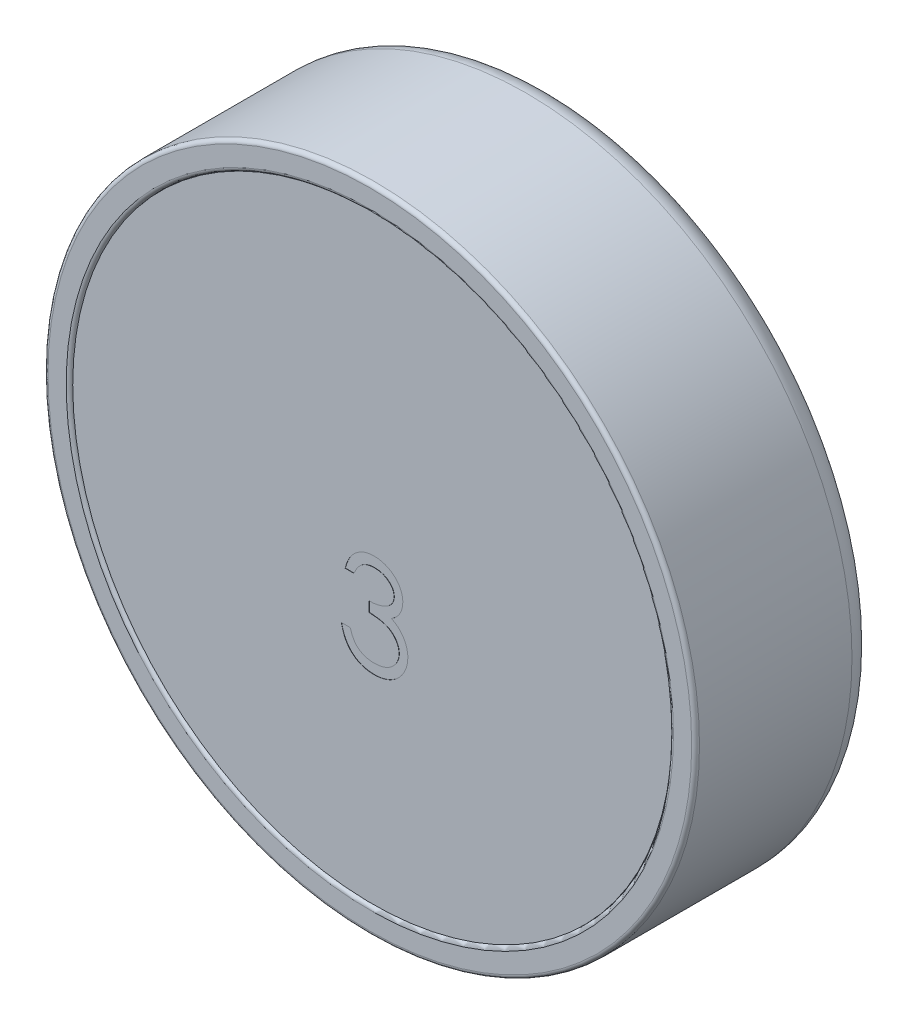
ISO-10303-21;
HEADER;
FILE_DESCRIPTION(('STEP AP214'),'2;1');
FILE_NAME('part.step','',(''),(''),'','','');
FILE_SCHEMA(('AUTOMOTIVE_DESIGN { 1 0 10303 214 1 1 1 1 }'));
ENDSEC;
DATA;
#1=APPLICATION_CONTEXT('core data for automotive mechanical design processes');
#2=APPLICATION_PROTOCOL_DEFINITION('international standard','automotive_design',2000,#1);
#3=PRODUCT_CONTEXT('',#1,'mechanical');
#4=PRODUCT('Part','Part','',(#3));
#5=PRODUCT_RELATED_PRODUCT_CATEGORY('part','',(#4));
#6=PRODUCT_DEFINITION_FORMATION('','',#4);
#7=PRODUCT_DEFINITION_CONTEXT('part definition',#1,'design');
#8=PRODUCT_DEFINITION('design','',#6,#7);
#9=PRODUCT_DEFINITION_SHAPE('','',#8);
#10=(LENGTH_UNIT() NAMED_UNIT(*) SI_UNIT(.MILLI.,.METRE.));
#11=(NAMED_UNIT(*) PLANE_ANGLE_UNIT() SI_UNIT($,.RADIAN.));
#12=(NAMED_UNIT(*) SI_UNIT($,.STERADIAN.) SOLID_ANGLE_UNIT());
#13=UNCERTAINTY_MEASURE_WITH_UNIT(LENGTH_MEASURE(1.E-05),#10,'distance_accuracy_value','');
#14=(GEOMETRIC_REPRESENTATION_CONTEXT(3) GLOBAL_UNCERTAINTY_ASSIGNED_CONTEXT((#13)) GLOBAL_UNIT_ASSIGNED_CONTEXT((#10,
#11,#12)) REPRESENTATION_CONTEXT('',''));
#15=CARTESIAN_POINT('',(0.,0.,0.));
#16=DIRECTION('',(0.,0.,1.));
#17=DIRECTION('',(1.,0.,0.));
#18=AXIS2_PLACEMENT_3D('',#15,#16,#17);
#19=CARTESIAN_POINT('',(0.,0.,17.272));
#20=DIRECTION('',(0.,0.,1.));
#21=DIRECTION('',(1.,0.,0.));
#22=AXIS2_PLACEMENT_3D('',#19,#20,#21);
#23=PLANE('',#22);
#24=CARTESIAN_POINT('',(0.,0.,17.272));
#25=DIRECTION('',(0.,0.,1.));
#26=DIRECTION('',(1.,0.,0.));
#27=AXIS2_PLACEMENT_3D('',#24,#25,#26);
#28=CIRCLE('',#27,29.21);
#29=CARTESIAN_POINT('',(-29.21,0.,17.272));
#30=VERTEX_POINT('',#29);
#31=EDGE_CURVE('E247',#30,#30,#28,.T.);
#32=ORIENTED_EDGE('',*,*,#31,.T.);
#33=EDGE_LOOP('',(#32));
#34=FACE_BOUND('',#33,.T.);
#35=CARTESIAN_POINT('',(2.10649038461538,-2.22669771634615,17.272));
#36=CARTESIAN_POINT('',(2.10536259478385,-2.17695613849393,17.272));
#37=CARTESIAN_POINT('',(2.10311891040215,-2.07799762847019,17.272));
#38=CARTESIAN_POINT('',(2.07482346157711,-1.93342154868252,17.272));
#39=CARTESIAN_POINT('',(2.03230375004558,-1.79326540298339,17.272));
#40=CARTESIAN_POINT('',(1.97384820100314,-1.65812521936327,17.272));
#41=CARTESIAN_POINT('',(1.89560658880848,-1.52893825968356,17.272));
#42=CARTESIAN_POINT('',(1.80197315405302,-1.40460313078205,17.272));
#43=CARTESIAN_POINT('',(1.69048139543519,-1.28582970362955,17.272));
#44=CARTESIAN_POINT('',(1.56272271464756,-1.17512111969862,17.272));
#45=CARTESIAN_POINT('',(1.42553058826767,-1.06961340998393,17.272));
#46=CARTESIAN_POINT('',(1.27517227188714,-0.980041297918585,17.272));
#47=CARTESIAN_POINT('',(1.11618131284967,-0.903446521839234,17.272));
#48=CARTESIAN_POINT('',(0.94838168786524,-0.84028351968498,17.272));
#49=CARTESIAN_POINT('',(0.771228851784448,-0.79276931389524,17.272));
#50=CARTESIAN_POINT('',(0.5855551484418,-0.75865391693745,17.272));
#51=CARTESIAN_POINT('',(0.391006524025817,-0.737324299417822,17.272));
#52=CARTESIAN_POINT('',(0.258277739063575,-0.734253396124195,17.272));
#53=CARTESIAN_POINT('',(0.190805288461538,-0.732692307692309,17.272));
#54=B_SPLINE_CURVE_WITH_KNOTS('',3,(#35,#36,#37,#38,#39,#40,#41,#42,#43,#44,#45,#46,#47,#48,#49,
#50,#51,#52,#53),.UNSPECIFIED.,.F.,.F.,(4,1,1,1,1,1,1,1,1,1,1,1,1,1,1,1,4),(0.,
0.0552745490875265,0.109966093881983,0.163247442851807,0.218076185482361,0.273300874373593,
0.330909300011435,0.390994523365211,0.454175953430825,0.518861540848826,0.583310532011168,
0.648516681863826,0.715030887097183,0.782502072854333,0.852322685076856,0.924928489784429,1.),.UNSPECIFIED.);
#55=CARTESIAN_POINT('',(2.10649038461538,-2.22669771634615,17.272));
#56=VERTEX_POINT('',#55);
#57=CARTESIAN_POINT('',(0.190805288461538,-0.732692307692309,17.272));
#58=VERTEX_POINT('',#57);
#59=EDGE_CURVE('E242',#56,#58,#54,.T.);
#60=ORIENTED_EDGE('',*,*,#59,.T.);
#61=CARTESIAN_POINT('',(0.190805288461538,-0.732692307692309,17.272));
#62=CARTESIAN_POINT('',(0.0823518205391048,-0.736478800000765,17.272));
#63=CARTESIAN_POINT('',(-0.129483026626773,-0.743874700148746,17.272));
#64=CARTESIAN_POINT('',(-0.434867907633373,-0.808652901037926,17.272));
#65=CARTESIAN_POINT('',(-0.718765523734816,-0.912007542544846,17.272));
#66=CARTESIAN_POINT('',(-0.93576860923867,-1.03537811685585,17.272));
#67=CARTESIAN_POINT('',(-1.09601332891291,-1.15716322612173,17.272));
#68=CARTESIAN_POINT('',(-1.21052271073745,-1.2635231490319,17.272));
#69=CARTESIAN_POINT('',(-1.32297352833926,-1.38172247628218,17.272));
#70=CARTESIAN_POINT('',(-1.42596783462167,-1.51904134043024,17.272));
#71=CARTESIAN_POINT('',(-1.53012772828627,-1.66618024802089,17.272));
#72=CARTESIAN_POINT('',(-1.62495471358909,-1.83061898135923,17.272));
#73=CARTESIAN_POINT('',(-1.71710144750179,-2.00806808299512,17.272));
#74=CARTESIAN_POINT('',(-1.77262552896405,-2.13351405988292,17.272));
#75=CARTESIAN_POINT('',(-1.80120192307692,-2.19807692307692,17.272));
#76=B_SPLINE_CURVE_WITH_KNOTS('',3,(#61,#62,#63,#64,#65,#66,#67,#68,#69,#70,#71,#72,#73,#74,
#75),.UNSPECIFIED.,.F.,.F.,(4,1,1,1,1,1,1,1,1,1,1,1,4),(0.,0.122711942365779,0.239684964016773,
0.351815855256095,0.463766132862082,0.520817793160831,0.579448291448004,0.640604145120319,
0.705297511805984,0.773633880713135,0.844669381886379,0.920056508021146,1.),.UNSPECIFIED.);
#77=CARTESIAN_POINT('',(-1.80120192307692,-2.19807692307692,17.272));
#78=VERTEX_POINT('',#77);
#79=EDGE_CURVE('E56',#58,#78,#76,.T.);
#80=ORIENTED_EDGE('',*,*,#79,.T.);
#81=DIRECTION('',(-1.,0.,0.));
#82=VECTOR('',#81,1.);
#83=CARTESIAN_POINT('',(-1.80120192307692,-2.19807692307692,17.272));
#84=LINE('',#83,#82);
#85=CARTESIAN_POINT('',(-2.65600961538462,-2.19807692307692,17.272));
#86=VERTEX_POINT('',#85);
#87=EDGE_CURVE('E246',#78,#86,#84,.T.);
#88=ORIENTED_EDGE('',*,*,#87,.T.);
#89=CARTESIAN_POINT('',(-2.65600961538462,-2.19807692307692,17.272));
#90=CARTESIAN_POINT('',(-2.63285148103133,-2.10219423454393,17.272));
#91=CARTESIAN_POINT('',(-2.58757922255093,-1.91475142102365,17.272));
#92=CARTESIAN_POINT('',(-2.49315225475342,-1.64694308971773,17.272));
#93=CARTESIAN_POINT('',(-2.3902842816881,-1.39351407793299,17.272));
#94=CARTESIAN_POINT('',(-2.26676107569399,-1.15920976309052,17.272));
#95=CARTESIAN_POINT('',(-2.13202653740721,-0.939321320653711,17.272));
#96=CARTESIAN_POINT('',(-1.9776597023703,-0.738836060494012,17.272));
#97=CARTESIAN_POINT('',(-1.81078245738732,-0.552655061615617,17.272));
#98=CARTESIAN_POINT('',(-1.62620170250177,-0.387428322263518,17.272));
#99=CARTESIAN_POINT('',(-1.43263013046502,-0.237810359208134,17.272));
#100=CARTESIAN_POINT('',(-1.22734020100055,-0.110243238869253,17.272));
#101=CARTESIAN_POINT('',(-1.01446218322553,-0.000503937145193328,17.272));
#102=CARTESIAN_POINT('',(-0.792521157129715,0.0899025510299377,17.272));
#103=CARTESIAN_POINT('',(-0.560856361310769,0.158007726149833,17.272));
#104=CARTESIAN_POINT('',(-0.321562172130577,0.207420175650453,17.272));
#105=CARTESIAN_POINT('',(-0.0740115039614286,0.239508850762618,17.272));
#106=CARTESIAN_POINT('',(0.0940301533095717,0.24264057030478,17.272));
#107=CARTESIAN_POINT('',(0.179356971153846,0.244230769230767,17.272));
#108=B_SPLINE_CURVE_WITH_KNOTS('',3,(#89,#90,#91,#92,#93,#94,#95,#96,#97,#98,#99,#100,#101,#102,
#103,#104,#105,#106,#107),.UNSPECIFIED.,.F.,.F.,(4,1,1,1,1,1,1,1,1,1,1,1,1,1,1,1,4),(0.,
0.0726253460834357,0.141976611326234,0.208984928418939,0.273956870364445,0.336889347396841,
0.39874495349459,0.460115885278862,0.520824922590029,0.580994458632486,0.640151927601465,
0.698622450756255,0.757271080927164,0.81642669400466,0.87625404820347,0.937165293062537,1.),.UNSPECIFIED.);
#109=CARTESIAN_POINT('',(0.179356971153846,0.244230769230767,17.272));
#110=VERTEX_POINT('',#109);
#111=EDGE_CURVE('E870',#86,#110,#108,.T.);
#112=ORIENTED_EDGE('',*,*,#111,.T.);
#113=CARTESIAN_POINT('',(0.179356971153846,0.244230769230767,17.272));
#114=CARTESIAN_POINT('',(0.303679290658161,0.240477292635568,17.272));
#115=CARTESIAN_POINT('',(0.549612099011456,0.233052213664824,17.272));
#116=CARTESIAN_POINT('',(0.910917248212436,0.165249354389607,17.272));
#117=CARTESIAN_POINT('',(1.25933309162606,0.0579566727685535,17.272));
#118=CARTESIAN_POINT('',(1.59104597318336,-0.0902896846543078,17.272));
#119=CARTESIAN_POINT('',(1.89916185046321,-0.273135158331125,17.272));
#120=CARTESIAN_POINT('',(2.17330818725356,-0.490753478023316,17.272));
#121=CARTESIAN_POINT('',(2.40976906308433,-0.738945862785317,17.272));
#122=CARTESIAN_POINT('',(2.60814590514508,-1.01308234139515,17.272));
#123=CARTESIAN_POINT('',(2.76347143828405,-1.30605912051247,17.272));
#124=CARTESIAN_POINT('',(2.87800649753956,-1.60759383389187,17.272));
#125=CARTESIAN_POINT('',(2.94773407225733,-1.916971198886,17.272));
#126=CARTESIAN_POINT('',(2.95677073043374,-2.12586065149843,17.272));
#127=CARTESIAN_POINT('',(2.96129807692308,-2.23051382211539,17.272));
#128=B_SPLINE_CURVE_WITH_KNOTS('',3,(#113,#114,#115,#116,#117,#118,#119,#120,#121,#122,#123,
#124,#125,#126,#127),.UNSPECIFIED.,.F.,.F.,(4,1,1,1,1,1,1,1,1,1,1,1,4),(0.,0.0902542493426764,
0.178539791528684,0.26609303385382,0.354630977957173,0.441886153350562,0.525746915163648,
0.608113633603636,0.690197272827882,0.770821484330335,0.848326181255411,0.924011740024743,1.),.UNSPECIFIED.);
#129=CARTESIAN_POINT('',(2.96129807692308,-2.23051382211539,17.272));
#130=VERTEX_POINT('',#129);
#131=EDGE_CURVE('E875',#110,#130,#128,.T.);
#132=ORIENTED_EDGE('',*,*,#131,.T.);
#133=CARTESIAN_POINT('',(2.96129807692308,-2.23051382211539,17.272));
#134=CARTESIAN_POINT('',(2.95813144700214,-2.33122517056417,17.272));
#135=CARTESIAN_POINT('',(2.95193484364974,-2.52830165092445,17.272));
#136=CARTESIAN_POINT('',(2.89931954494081,-2.81601515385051,17.272));
#137=CARTESIAN_POINT('',(2.81077442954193,-3.08718265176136,17.272));
#138=CARTESIAN_POINT('',(2.68812028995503,-3.34294567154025,17.272));
#139=CARTESIAN_POINT('',(2.5293479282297,-3.58168255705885,17.272));
#140=CARTESIAN_POINT('',(2.33701723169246,-3.8039304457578,17.272));
#141=CARTESIAN_POINT('',(2.1097707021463,-4.01067508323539,17.272));
#142=CARTESIAN_POINT('',(1.93756159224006,-4.12911022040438,17.272));
#143=CARTESIAN_POINT('',(1.84890324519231,-4.19008413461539,17.272));
#144=B_SPLINE_CURVE_WITH_KNOTS('',3,(#133,#134,#135,#136,#137,#138,#139,#140,#141,#142,#143),
.UNSPECIFIED.,.F.,.F.,(4,1,1,1,1,1,1,1,4),(0.,0.128067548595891,0.250608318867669,
0.370630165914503,0.490072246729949,0.61037476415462,0.734313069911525,0.863216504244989,1.),.UNSPECIFIED.);
#145=CARTESIAN_POINT('',(1.84890324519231,-4.19008413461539,17.272));
#146=VERTEX_POINT('',#145);
#147=EDGE_CURVE('E883',#130,#146,#144,.T.);
#148=ORIENTED_EDGE('',*,*,#147,.T.);
#149=CARTESIAN_POINT('',(1.84890324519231,-4.19008413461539,17.272));
#150=CARTESIAN_POINT('',(1.9502268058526,-4.23901044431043,17.272));
#151=CARTESIAN_POINT('',(2.15097808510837,-4.33594761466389,17.272));
#152=CARTESIAN_POINT('',(2.42461916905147,-4.5260550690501,17.272));
#153=CARTESIAN_POINT('',(2.6730253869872,-4.74555555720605,17.272));
#154=CARTESIAN_POINT('',(2.8115562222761,-4.91684949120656,17.272));
#155=CARTESIAN_POINT('',(2.88115985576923,-5.00291466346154,17.272));
#156=B_SPLINE_CURVE_WITH_KNOTS('',3,(#149,#150,#151,#152,#153,#154,#155),.UNSPECIFIED.,.F.,.F.,
(4,1,1,1,4),(0.,0.253879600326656,0.503008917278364,0.750291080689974,1.),.UNSPECIFIED.);
#157=CARTESIAN_POINT('',(2.88115985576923,-5.00291466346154,17.272));
#158=VERTEX_POINT('',#157);
#159=EDGE_CURVE('E891',#146,#158,#156,.T.);
#160=ORIENTED_EDGE('',*,*,#159,.T.);
#161=CARTESIAN_POINT('',(2.88115985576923,-5.00291466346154,17.272));
#162=CARTESIAN_POINT('',(2.92699236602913,-5.06566468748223,17.272));
#163=CARTESIAN_POINT('',(3.01790684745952,-5.19013716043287,17.272));
#164=CARTESIAN_POINT('',(3.13012640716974,-5.39026129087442,17.272));
#165=CARTESIAN_POINT('',(3.23193263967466,-5.59260355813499,17.272));
#166=CARTESIAN_POINT('',(3.3112628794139,-5.80258737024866,17.272));
#167=CARTESIAN_POINT('',(3.37269604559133,-6.01777892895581,17.272));
#168=CARTESIAN_POINT('',(3.41660910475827,-6.23854773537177,17.272));
#169=CARTESIAN_POINT('',(3.44388908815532,-6.46507406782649,17.272));
#170=CARTESIAN_POINT('',(3.4477958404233,-6.61832446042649,17.272));
#171=CARTESIAN_POINT('',(3.44975961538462,-6.69535757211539,17.272));
#172=B_SPLINE_CURVE_WITH_KNOTS('',3,(#161,#162,#163,#164,#165,#166,#167,#168,#169,#170,#171),
.UNSPECIFIED.,.F.,.F.,(4,1,1,1,1,1,1,1,4),(0.,0.128135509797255,0.25417271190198,
0.378111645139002,0.501712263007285,0.623986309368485,0.747095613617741,0.872874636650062,1.),.UNSPECIFIED.);
#173=CARTESIAN_POINT('',(3.44975961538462,-6.69535757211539,17.272));
#174=VERTEX_POINT('',#173);
#175=EDGE_CURVE('E899',#158,#174,#172,.T.);
#176=ORIENTED_EDGE('',*,*,#175,.T.);
#177=CARTESIAN_POINT('',(3.44975961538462,-6.69535757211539,17.272));
#178=CARTESIAN_POINT('',(3.44487597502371,-6.82873402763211,17.272));
#179=CARTESIAN_POINT('',(3.43513167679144,-7.09485926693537,17.272));
#180=CARTESIAN_POINT('',(3.34803487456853,-7.48803690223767,17.272));
#181=CARTESIAN_POINT('',(3.21301598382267,-7.87237201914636,17.272));
#182=CARTESIAN_POINT('',(3.02127246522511,-8.23996854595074,17.272));
#183=CARTESIAN_POINT('',(2.78759017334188,-8.58390372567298,17.272));
#184=CARTESIAN_POINT('',(2.50957631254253,-8.89163282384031,17.272));
#185=CARTESIAN_POINT('',(2.19038972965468,-9.15615188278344,17.272));
#186=CARTESIAN_POINT('',(1.83441149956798,-9.37715971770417,17.272));
#187=CARTESIAN_POINT('',(1.44873845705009,-9.55382920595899,17.272));
#188=CARTESIAN_POINT('',(1.03623631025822,-9.67644981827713,17.272));
#189=CARTESIAN_POINT('',(0.6028486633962,-9.75631286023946,17.272));
#190=CARTESIAN_POINT('',(0.305648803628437,-9.7648768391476,17.272));
#191=CARTESIAN_POINT('',(0.154552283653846,-9.76923076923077,17.272));
#192=B_SPLINE_CURVE_WITH_KNOTS('',3,(#177,#178,#179,#180,#181,#182,#183,#184,#185,#186,#187,
#188,#189,#190,#191),.UNSPECIFIED.,.F.,.F.,(4,1,1,1,1,1,1,1,1,1,1,1,4),(0.,0.0796482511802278,
0.158921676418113,0.239619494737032,0.322609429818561,0.406034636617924,0.487602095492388,
0.569684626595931,0.653036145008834,0.737435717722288,0.82247781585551,0.909747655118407,1.),.UNSPECIFIED.);
#193=CARTESIAN_POINT('',(0.154552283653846,-9.76923076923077,17.272));
#194=VERTEX_POINT('',#193);
#195=EDGE_CURVE('E907',#174,#194,#192,.T.);
#196=ORIENTED_EDGE('',*,*,#195,.T.);
#197=CARTESIAN_POINT('',(0.154552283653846,-9.76923076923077,17.272));
#198=CARTESIAN_POINT('',(0.0527183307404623,-9.76686798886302,17.272));
#199=CARTESIAN_POINT('',(-0.147656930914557,-9.762218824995,17.272));
#200=CARTESIAN_POINT('',(-0.442233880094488,-9.73043634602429,17.272));
#201=CARTESIAN_POINT('',(-0.72341650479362,-9.67238826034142,17.272));
#202=CARTESIAN_POINT('',(-0.991584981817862,-9.59427426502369,17.272));
#203=CARTESIAN_POINT('',(-1.24697754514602,-9.49523673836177,17.272));
#204=CARTESIAN_POINT('',(-1.48881485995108,-9.3719051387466,17.272));
#205=CARTESIAN_POINT('',(-1.71858478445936,-9.22682169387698,17.272));
#206=CARTESIAN_POINT('',(-1.93411907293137,-9.05827385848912,17.272));
#207=CARTESIAN_POINT('',(-2.13539203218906,-8.86972964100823,17.272));
#208=CARTESIAN_POINT('',(-2.31705480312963,-8.65784190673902,17.272));
#209=CARTESIAN_POINT('',(-2.48213609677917,-8.42652754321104,17.272));
#210=CARTESIAN_POINT('',(-2.62621570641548,-8.17309979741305,17.272));
#211=CARTESIAN_POINT('',(-2.75585627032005,-7.90083377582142,17.272));
#212=CARTESIAN_POINT('',(-2.86248444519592,-7.60624321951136,17.272));
#213=CARTESIAN_POINT('',(-2.95633445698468,-7.29196170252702,17.272));
#214=CARTESIAN_POINT('',(-2.99996838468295,-7.07294728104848,17.272));
#215=CARTESIAN_POINT('',(-3.02235576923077,-6.96057692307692,17.272));
#216=B_SPLINE_CURVE_WITH_KNOTS('',3,(#197,#198,#199,#200,#201,#202,#203,#204,#205,#206,#207,
#208,#209,#210,#211,#212,#213,#214,#215),.UNSPECIFIED.,.F.,.F.,(4,1,1,1,1,1,1,1,1,1,1,1,1,1,1,1,
4),(0.,0.0655411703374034,0.128963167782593,0.190377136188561,0.250092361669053,
0.308548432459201,0.366397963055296,0.42454218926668,0.483169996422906,0.54224339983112,
0.60173935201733,0.662506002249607,0.724855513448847,0.789127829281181,0.85634639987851,
0.926295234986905,1.),.UNSPECIFIED.);
#217=CARTESIAN_POINT('',(-3.02235576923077,-6.96057692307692,17.272));
#218=VERTEX_POINT('',#217);
#219=EDGE_CURVE('E915',#194,#218,#216,.T.);
#220=ORIENTED_EDGE('',*,*,#219,.T.);
#221=DIRECTION('',(1.,0.,0.));
#222=VECTOR('',#221,1.);
#223=CARTESIAN_POINT('',(-3.02235576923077,-6.96057692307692,17.272));
#224=LINE('',#223,#222);
#225=CARTESIAN_POINT('',(-2.16754807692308,-6.96057692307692,17.272));
#226=VERTEX_POINT('',#225);
#227=EDGE_CURVE('E923',#218,#226,#224,.T.);
#228=ORIENTED_EDGE('',*,*,#227,.T.);
#229=CARTESIAN_POINT('',(-2.16754807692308,-6.96057692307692,17.272));
#230=CARTESIAN_POINT('',(-2.14527783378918,-7.03391673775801,17.272));
#231=CARTESIAN_POINT('',(-2.10196027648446,-7.17656904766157,17.272));
#232=CARTESIAN_POINT('',(-2.02822507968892,-7.38187445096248,17.272));
#233=CARTESIAN_POINT('',(-1.94421928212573,-7.57008315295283,17.272));
#234=CARTESIAN_POINT('',(-1.85410037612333,-7.74257579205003,17.272));
#235=CARTESIAN_POINT('',(-1.75945331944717,-7.90105111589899,17.272));
#236=CARTESIAN_POINT('',(-1.65354913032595,-8.04131863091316,17.272));
#237=CARTESIAN_POINT('',(-1.5442316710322,-8.16953928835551,17.272));
#238=CARTESIAN_POINT('',(-1.46182857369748,-8.24177855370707,17.272));
#239=CARTESIAN_POINT('',(-1.42149939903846,-8.27713341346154,17.272));
#240=B_SPLINE_CURVE_WITH_KNOTS('',3,(#229,#230,#231,#232,#233,#234,#235,#236,#237,#238,#239),
.UNSPECIFIED.,.F.,.F.,(4,1,1,1,1,1,1,1,4),(0.,0.149770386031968,0.291316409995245,
0.425966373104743,0.552159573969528,0.671527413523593,0.786121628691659,0.895325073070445,1.),.UNSPECIFIED.);
#241=CARTESIAN_POINT('',(-1.42149939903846,-8.27713341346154,17.272));
#242=VERTEX_POINT('',#241);
#243=EDGE_CURVE('E929',#226,#242,#240,.T.);
#244=ORIENTED_EDGE('',*,*,#243,.T.);
#245=CARTESIAN_POINT('',(-1.42149939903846,-8.27713341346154,17.272));
#246=CARTESIAN_POINT('',(-1.36816871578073,-8.31824966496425,17.272));
#247=CARTESIAN_POINT('',(-1.2616719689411,-8.40035525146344,17.272));
#248=CARTESIAN_POINT('',(-1.08813128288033,-8.50513468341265,17.272));
#249=CARTESIAN_POINT('',(-0.905618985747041,-8.59592433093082,17.272));
#250=CARTESIAN_POINT('',(-0.710180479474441,-8.66527638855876,17.272));
#251=CARTESIAN_POINT('',(-0.506033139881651,-8.72399845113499,17.272));
#252=CARTESIAN_POINT('',(-0.289877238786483,-8.76242643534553,17.272));
#253=CARTESIAN_POINT('',(-0.0636197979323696,-8.78879210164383,17.272));
#254=CARTESIAN_POINT('',(0.0908696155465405,-8.79111873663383,17.272));
#255=CARTESIAN_POINT('',(0.169816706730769,-8.79230769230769,17.272));
#256=B_SPLINE_CURVE_WITH_KNOTS('',3,(#245,#246,#247,#248,#249,#250,#251,#252,#253,#254,#255),
.UNSPECIFIED.,.F.,.F.,(4,1,1,1,1,1,1,1,4),(0.,0.118271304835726,0.236177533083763,
0.355662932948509,0.475904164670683,0.600127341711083,0.72860811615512,0.861313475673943,1.),.UNSPECIFIED.);
#257=CARTESIAN_POINT('',(0.169816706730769,-8.79230769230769,17.272));
#258=VERTEX_POINT('',#257);
#259=EDGE_CURVE('E934',#242,#258,#256,.T.);
#260=ORIENTED_EDGE('',*,*,#259,.T.);
#261=CARTESIAN_POINT('',(0.169816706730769,-8.79230769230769,17.272));
#262=CARTESIAN_POINT('',(0.258953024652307,-8.79063155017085,17.272));
#263=CARTESIAN_POINT('',(0.433251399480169,-8.78735399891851,17.272));
#264=CARTESIAN_POINT('',(0.687582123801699,-8.75721225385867,17.272));
#265=CARTESIAN_POINT('',(0.929537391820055,-8.71331448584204,17.272));
#266=CARTESIAN_POINT('',(1.15643085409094,-8.64551558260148,17.272));
#267=CARTESIAN_POINT('',(1.37123459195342,-8.56174769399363,17.272));
#268=CARTESIAN_POINT('',(1.57093750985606,-8.45656881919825,17.272));
#269=CARTESIAN_POINT('',(1.75816119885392,-8.33316639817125,17.272));
#270=CARTESIAN_POINT('',(1.93050765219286,-8.19290625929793,17.272));
#271=CARTESIAN_POINT('',(2.08548078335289,-8.03935919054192,17.272));
#272=CARTESIAN_POINT('',(2.22193188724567,-7.87875933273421,17.272));
#273=CARTESIAN_POINT('',(2.33793185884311,-7.71178382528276,17.272));
#274=CARTESIAN_POINT('',(2.43150431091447,-7.53750865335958,17.272));
#275=CARTESIAN_POINT('',(2.50539259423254,-7.3566554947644,17.272));
#276=CARTESIAN_POINT('',(2.55569330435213,-7.16871682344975,17.272));
#277=CARTESIAN_POINT('',(2.5906677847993,-6.97523069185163,17.272));
#278=CARTESIAN_POINT('',(2.59351606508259,-6.84370685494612,17.272));
#279=CARTESIAN_POINT('',(2.59495192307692,-6.77740384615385,17.272));
#280=B_SPLINE_CURVE_WITH_KNOTS('',3,(#261,#262,#263,#264,#265,#266,#267,#268,#269,#270,#271,
#272,#273,#274,#275,#276,#277,#278,#279),.UNSPECIFIED.,.F.,.F.,(4,1,1,1,1,1,1,1,1,1,1,1,1,1,1,1,
4),(0.,0.0760717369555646,0.148751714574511,0.218402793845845,0.285759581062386,
0.350598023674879,0.414964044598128,0.478069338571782,0.541760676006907,0.604349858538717,
0.664075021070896,0.721463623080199,0.777587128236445,0.832644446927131,0.88784351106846,
0.943460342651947,1.),.UNSPECIFIED.);
#281=CARTESIAN_POINT('',(2.59495192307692,-6.77740384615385,17.272));
#282=VERTEX_POINT('',#281);
#283=EDGE_CURVE('E942',#258,#282,#280,.T.);
#284=ORIENTED_EDGE('',*,*,#283,.T.);
#285=CARTESIAN_POINT('',(2.59495192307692,-6.77740384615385,17.272));
#286=CARTESIAN_POINT('',(2.5907873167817,-6.68865441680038,17.272));
#287=CARTESIAN_POINT('',(2.58247882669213,-6.51159716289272,17.272));
#288=CARTESIAN_POINT('',(2.51904619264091,-6.25110862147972,17.272));
#289=CARTESIAN_POINT('',(2.41470971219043,-6.0001291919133,17.272));
#290=CARTESIAN_POINT('',(2.26864380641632,-5.76294093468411,17.272));
#291=CARTESIAN_POINT('',(2.09083728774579,-5.54311508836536,17.272));
#292=CARTESIAN_POINT('',(1.88301564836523,-5.3469776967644,17.272));
#293=CARTESIAN_POINT('',(1.64345311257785,-5.18513409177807,17.272));
#294=CARTESIAN_POINT('',(1.42296332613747,-5.07331424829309,17.272));
#295=CARTESIAN_POINT('',(1.2276595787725,-4.99701335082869,17.272));
#296=CARTESIAN_POINT('',(1.06052199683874,-4.94619076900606,17.272));
#297=CARTESIAN_POINT('',(0.873405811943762,-4.90315503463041,17.272));
#298=CARTESIAN_POINT('',(0.668573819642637,-4.86311663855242,17.272));
#299=CARTESIAN_POINT('',(0.444482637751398,-4.82904068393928,17.272));
#300=CARTESIAN_POINT('',(0.201376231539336,-4.80062402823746,17.272));
#301=CARTESIAN_POINT('',(-0.0607946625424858,-4.77788638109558,17.272));
#302=CARTESIAN_POINT('',(-0.24228990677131,-4.76773247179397,17.272));
#303=CARTESIAN_POINT('',(-0.335817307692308,-4.7625,17.272));
#304=B_SPLINE_CURVE_WITH_KNOTS('',3,(#285,#286,#287,#288,#289,#290,#291,#292,#293,#294,#295,
#296,#297,#298,#299,#300,#301,#302,#303),.UNSPECIFIED.,.F.,.F.,(4,1,1,1,1,1,1,1,1,1,1,1,1,1,1,1,
4),(0.,0.0669091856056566,0.133485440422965,0.201035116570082,0.271234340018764,
0.342879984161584,0.41383612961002,0.48597662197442,0.560229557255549,0.599884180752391,
0.644054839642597,0.691891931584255,0.744687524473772,0.801491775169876,0.862857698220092,
0.929328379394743,1.),.UNSPECIFIED.);
#305=CARTESIAN_POINT('',(-0.335817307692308,-4.7625,17.272));
#306=VERTEX_POINT('',#305);
#307=EDGE_CURVE('E950',#282,#306,#304,.T.);
#308=ORIENTED_EDGE('',*,*,#307,.T.);
#309=DIRECTION('',(0.,1.,0.));
#310=VECTOR('',#309,1.);
#311=CARTESIAN_POINT('',(-0.335817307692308,-4.7625,17.272));
#312=LINE('',#311,#310);
#313=CARTESIAN_POINT('',(-0.335817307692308,-3.78557692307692,17.272));
#314=VERTEX_POINT('',#313);
#315=EDGE_CURVE('E958',#306,#314,#312,.T.);
#316=ORIENTED_EDGE('',*,*,#315,.T.);
#317=CARTESIAN_POINT('',(-0.335817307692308,-3.78557692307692,17.272));
#318=CARTESIAN_POINT('',(-0.217976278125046,-3.78357720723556,17.272));
#319=CARTESIAN_POINT('',(0.0128453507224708,-3.77966025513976,17.272));
#320=CARTESIAN_POINT('',(0.350014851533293,-3.73228559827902,17.272));
#321=CARTESIAN_POINT('',(0.672431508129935,-3.66675188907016,17.272));
#322=CARTESIAN_POINT('',(0.972949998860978,-3.56637147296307,17.272));
#323=CARTESIAN_POINT('',(1.24685828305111,-3.44978466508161,17.272));
#324=CARTESIAN_POINT('',(1.48449234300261,-3.31411543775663,17.272));
#325=CARTESIAN_POINT('',(1.68252293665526,-3.16330815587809,17.272));
#326=CARTESIAN_POINT('',(1.83998770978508,-2.99503512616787,17.272));
#327=CARTESIAN_POINT('',(1.95844939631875,-2.814563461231,17.272));
#328=CARTESIAN_POINT('',(2.04506375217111,-2.62646741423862,17.272));
#329=CARTESIAN_POINT('',(2.09622749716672,-2.4290983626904,17.272));
#330=CARTESIAN_POINT('',(2.10305737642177,-2.29440215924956,17.272));
#331=CARTESIAN_POINT('',(2.10649038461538,-2.22669771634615,17.272));
#332=B_SPLINE_CURVE_WITH_KNOTS('',3,(#317,#318,#319,#320,#321,#322,#323,#324,#325,#326,#327,
#328,#329,#330,#331),.UNSPECIFIED.,.F.,.F.,(4,1,1,1,1,1,1,1,1,1,1,1,4),(0.,0.110165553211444,
0.215787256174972,0.318027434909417,0.417573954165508,0.511650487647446,0.596162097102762,
0.672934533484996,0.743669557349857,0.810677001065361,0.874058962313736,0.936696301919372,1.),.UNSPECIFIED.);
#333=EDGE_CURVE('E964',#314,#56,#332,.T.);
#334=ORIENTED_EDGE('',*,*,#333,.T.);
#335=EDGE_LOOP('',(#60,#80,#88,#112,#132,#148,#160,#176,#196,#220,#228,#244,#260,#284,#308,#316,#334));
#336=FACE_BOUND('',#335,.T.);
#337=ADVANCED_FACE('F40',(#34,#336),#23,.T.);
#338=CARTESIAN_POINT('',(0.,0.,0.));
#339=DIRECTION('',(0.,0.,1.));
#340=DIRECTION('',(1.,0.,0.));
#341=AXIS2_PLACEMENT_3D('',#338,#339,#340);
#342=PLANE('',#341);
#343=CARTESIAN_POINT('',(0.,0.,0.));
#344=DIRECTION('',(0.,0.,1.));
#345=DIRECTION('',(0.,-1.,0.));
#346=AXIS2_PLACEMENT_3D('',#343,#344,#345);
#347=CIRCLE('',#346,13.2524303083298);
#348=CARTESIAN_POINT('',(0.,-13.2524303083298,0.));
#349=VERTEX_POINT('',#348);
#350=EDGE_CURVE('E268',#349,#349,#347,.T.);
#351=ORIENTED_EDGE('',*,*,#350,.F.);
#352=EDGE_LOOP('',(#351));
#353=FACE_BOUND('',#352,.T.);
#354=CARTESIAN_POINT('',(0.,0.,0.));
#355=DIRECTION('',(0.,0.,1.));
#356=DIRECTION('',(1.,0.,0.));
#357=AXIS2_PLACEMENT_3D('',#354,#355,#356);
#358=CIRCLE('',#357,7.112);
#359=CARTESIAN_POINT('',(7.112,0.,0.));
#360=VERTEX_POINT('',#359);
#361=EDGE_CURVE('E412',#360,#360,#358,.T.);
#362=ORIENTED_EDGE('',*,*,#361,.T.);
#363=EDGE_LOOP('',(#362));
#364=FACE_BOUND('',#363,.T.);
#365=ADVANCED_FACE('F360',(#353,#364),#342,.F.);
#366=CARTESIAN_POINT('',(0.,0.,-3.175));
#367=DIRECTION('',(0.,0.,-1.));
#368=DIRECTION('',(-1.,0.,0.));
#369=AXIS2_PLACEMENT_3D('',#366,#367,#368);
#370=PLANE('',#369);
#371=CARTESIAN_POINT('',(0.,0.,-3.175));
#372=DIRECTION('',(0.,0.,-1.));
#373=DIRECTION('',(-1.,0.,0.));
#374=AXIS2_PLACEMENT_3D('',#371,#372,#373);
#375=CIRCLE('',#374,7.1755);
#376=CARTESIAN_POINT('',(-5.06768194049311,5.08,-3.175));
#377=VERTEX_POINT('',#376);
#378=CARTESIAN_POINT('',(-5.06768194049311,-5.08,-3.175));
#379=VERTEX_POINT('',#378);
#380=EDGE_CURVE('E420',#377,#379,#375,.F.);
#381=ORIENTED_EDGE('',*,*,#380,.T.);
#382=DIRECTION('',(1.,0.,0.));
#383=VECTOR('',#382,1.);
#384=CARTESIAN_POINT('',(0.,-5.08,-3.175));
#385=LINE('',#384,#383);
#386=CARTESIAN_POINT('',(-3.81,-5.08,-3.175));
#387=VERTEX_POINT('',#386);
#388=EDGE_CURVE('E64',#379,#387,#385,.T.);
#389=ORIENTED_EDGE('',*,*,#388,.T.);
#390=CARTESIAN_POINT('',(0.,0.,-3.175));
#391=DIRECTION('',(0.,0.,-1.));
#392=DIRECTION('',(-1.,0.,0.));
#393=AXIS2_PLACEMENT_3D('',#390,#391,#392);
#394=CIRCLE('',#393,6.35);
#395=CARTESIAN_POINT('',(-3.81,5.08,-3.175));
#396=VERTEX_POINT('',#395);
#397=EDGE_CURVE('E463',#387,#396,#394,.T.);
#398=ORIENTED_EDGE('',*,*,#397,.T.);
#399=DIRECTION('',(-1.,0.,0.));
#400=VECTOR('',#399,1.);
#401=CARTESIAN_POINT('',(6.89214892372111,5.08,-3.175));
#402=LINE('',#401,#400);
#403=EDGE_CURVE('E454',#396,#377,#402,.T.);
#404=ORIENTED_EDGE('',*,*,#403,.T.);
#405=EDGE_LOOP('',(#381,#389,#398,#404));
#406=FACE_BOUND('',#405,.T.);
#407=ADVANCED_FACE('F366',(#406),#370,.F.);
#408=CARTESIAN_POINT('',(0.,0.,-11.43));
#409=DIRECTION('',(0.,0.,1.));
#410=DIRECTION('',(1.,0.,0.));
#411=AXIS2_PLACEMENT_3D('',#408,#409,#410);
#412=CYLINDRICAL_SURFACE('',#411,7.9375);
#413=CARTESIAN_POINT('',(0.,0.,-10.668));
#414=DIRECTION('',(0.,0.,-1.));
#415=DIRECTION('',(-1.,0.,0.));
#416=AXIS2_PLACEMENT_3D('',#413,#414,#415);
#417=CIRCLE('',#416,7.9375);
#418=CARTESIAN_POINT('',(-6.09897583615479,5.08,-10.668));
#419=VERTEX_POINT('',#418);
#420=CARTESIAN_POINT('',(-6.09897583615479,-5.08,-10.668));
#421=VERTEX_POINT('',#420);
#422=EDGE_CURVE('E468',#419,#421,#417,.F.);
#423=ORIENTED_EDGE('',*,*,#422,.T.);
#424=DIRECTION('',(0.,0.,1.));
#425=VECTOR('',#424,1.);
#426=CARTESIAN_POINT('',(-6.09897583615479,-5.08,-11.43));
#427=LINE('',#426,#425);
#428=CARTESIAN_POINT('',(-6.09897583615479,-5.08,-3.93699999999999));
#429=VERTEX_POINT('',#428);
#430=EDGE_CURVE('E283',#421,#429,#427,.T.);
#431=ORIENTED_EDGE('',*,*,#430,.T.);
#432=CARTESIAN_POINT('',(0.,0.,-3.93699999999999));
#433=DIRECTION('',(0.,0.,-1.));
#434=DIRECTION('',(-1.,0.,0.));
#435=AXIS2_PLACEMENT_3D('',#432,#433,#434);
#436=CIRCLE('',#435,7.9375);
#437=CARTESIAN_POINT('',(-6.09897583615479,5.08,-3.93699999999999));
#438=VERTEX_POINT('',#437);
#439=EDGE_CURVE('E477',#429,#438,#436,.T.);
#440=ORIENTED_EDGE('',*,*,#439,.T.);
#441=DIRECTION('',(0.,0.,1.));
#442=VECTOR('',#441,1.);
#443=CARTESIAN_POINT('',(-6.09897583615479,5.08,-11.43));
#444=LINE('',#443,#442);
#445=EDGE_CURVE('E457',#438,#419,#444,.F.);
#446=ORIENTED_EDGE('',*,*,#445,.T.);
#447=EDGE_LOOP('',(#423,#431,#440,#446));
#448=FACE_BOUND('',#447,.T.);
#449=ADVANCED_FACE('F514',(#448),#412,.T.);
#450=CARTESIAN_POINT('',(0.,0.,-11.43));
#451=DIRECTION('',(0.,0.,1.));
#452=DIRECTION('',(1.,0.,0.));
#453=AXIS2_PLACEMENT_3D('',#450,#451,#452);
#454=CONICAL_SURFACE('',#453,7.17550000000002,0.785398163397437);
#455=CARTESIAN_POINT('',(-15.7349133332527,-5.08,-2.07087277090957));
#456=CARTESIAN_POINT('',(-15.4617593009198,-5.08,-2.33080681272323));
#457=CARTESIAN_POINT('',(-15.1882941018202,-5.08,-2.59041464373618));
#458=CARTESIAN_POINT('',(-14.6406190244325,-5.08,-3.10884693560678));
#459=CARTESIAN_POINT('',(-14.3664091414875,-5.08,-3.36767139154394));
#460=CARTESIAN_POINT('',(-13.8170163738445,-5.08,-3.88450563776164));
#461=CARTESIAN_POINT('',(-13.5418331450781,-5.08,-4.14251506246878));
#462=CARTESIAN_POINT('',(-12.9904461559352,-5.08,-4.65744051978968));
#463=CARTESIAN_POINT('',(-12.7142423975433,-5.08,-4.91435655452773));
#464=CARTESIAN_POINT('',(-12.1573950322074,-5.08,-5.42986197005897));
#465=CARTESIAN_POINT('',(-11.8767371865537,-5.08,-5.68843597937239));
#466=CARTESIAN_POINT('',(-11.3139229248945,-5.08,-6.20394801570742));
#467=CARTESIAN_POINT('',(-11.0317665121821,-5.08,-6.46088604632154));
#468=CARTESIAN_POINT('',(-10.4657044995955,-5.08,-6.97266960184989));
#469=CARTESIAN_POINT('',(-10.1817994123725,-5.08,-7.22751569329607));
#470=CARTESIAN_POINT('',(-9.61173457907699,-5.08,-7.73467337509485));
#471=CARTESIAN_POINT('',(-9.32557485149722,-5.08,-7.98698498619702));
#472=CARTESIAN_POINT('',(-8.82230372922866,-5.08,-8.42570158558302));
#473=CARTESIAN_POINT('',(-8.60581169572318,-5.08,-8.61281663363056));
#474=CARTESIAN_POINT('',(-8.17091851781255,-5.08,-8.98481352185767));
#475=CARTESIAN_POINT('',(-7.95251739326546,-5.08,-9.16969538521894));
#476=CARTESIAN_POINT('',(-7.51324048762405,-5.08,-9.53683848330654));
#477=CARTESIAN_POINT('',(-7.29236296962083,-5.08,-9.71909764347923));
#478=CARTESIAN_POINT('',(-6.84778826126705,-5.08,-10.0801397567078));
#479=CARTESIAN_POINT('',(-6.6240911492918,-5.08,-10.2589228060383));
#480=CARTESIAN_POINT('',(-6.17370263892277,-5.08,-10.6116633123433));
#481=CARTESIAN_POINT('',(-5.94701886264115,-5.08,-10.785630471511));
#482=CARTESIAN_POINT('',(-5.48929202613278,-5.08,-11.127827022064));
#483=CARTESIAN_POINT('',(-5.25824837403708,-5.08,-11.2960556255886));
#484=CARTESIAN_POINT('',(-4.79101200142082,-5.08,-11.624624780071));
#485=CARTESIAN_POINT('',(-4.55482591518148,-5.08,-11.7849747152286));
#486=CARTESIAN_POINT('',(-4.07569600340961,-5.08,-12.0951772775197));
#487=CARTESIAN_POINT('',(-3.83275463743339,-5.08,-12.2450336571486));
#488=CARTESIAN_POINT('',(-3.40175482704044,-5.08,-12.4935567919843));
#489=CARTESIAN_POINT('',(-3.21559449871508,-5.08,-12.5954972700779));
#490=CARTESIAN_POINT('',(-2.83778339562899,-5.08,-12.7888808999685));
#491=CARTESIAN_POINT('',(-2.64613138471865,-5.08,-12.8803216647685));
#492=CARTESIAN_POINT('',(-2.25760202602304,-5.08,-13.0491801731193));
#493=CARTESIAN_POINT('',(-2.06074923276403,-5.08,-13.126653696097));
#494=CARTESIAN_POINT('',(-1.66101391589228,-5.08,-13.2641281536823));
#495=CARTESIAN_POINT('',(-1.45813499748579,-5.08,-13.3241393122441));
#496=CARTESIAN_POINT('',(-1.1048968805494,-5.08,-13.4087120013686));
#497=CARTESIAN_POINT('',(-0.955789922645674,-5.08,-13.4384960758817));
#498=CARTESIAN_POINT('',(-0.655599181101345,-5.08,-13.4855133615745));
#499=CARTESIAN_POINT('',(-0.504515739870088,-5.08,-13.5027487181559));
#500=CARTESIAN_POINT('',(-0.201609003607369,-5.08,-13.5237428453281));
#501=CARTESIAN_POINT('',(-0.0497869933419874,-5.08,-13.5275199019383));
#502=CARTESIAN_POINT('',(0.253587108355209,-5.08,-13.5214362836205));
#503=CARTESIAN_POINT('',(0.40513918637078,-5.08,-13.5115749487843));
#504=CARTESIAN_POINT('',(0.706086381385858,-5.08,-13.4788369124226));
#505=CARTESIAN_POINT('',(0.855488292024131,-5.08,-13.4560216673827));
#506=CARTESIAN_POINT('',(1.15200468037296,-5.08,-13.3985490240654));
#507=CARTESIAN_POINT('',(1.29911855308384,-5.08,-13.3638885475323));
#508=CARTESIAN_POINT('',(1.59084863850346,-5.08,-13.2840858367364));
#509=CARTESIAN_POINT('',(1.73545746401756,-5.08,-13.2389169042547));
#510=CARTESIAN_POINT('',(2.02154544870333,-5.08,-13.1396931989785));
#511=CARTESIAN_POINT('',(2.1630248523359,-5.08,-13.0856391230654));
#512=CARTESIAN_POINT('',(2.51101473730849,-5.08,-12.9419639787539));
#513=CARTESIAN_POINT('',(2.71566002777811,-5.08,-12.8478372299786));
#514=CARTESIAN_POINT('',(3.11877546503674,-5.08,-12.647095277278));
#515=CARTESIAN_POINT('',(3.31724180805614,-5.08,-12.5404725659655));
#516=CARTESIAN_POINT('',(3.70921197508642,-5.08,-12.3175256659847));
#517=CARTESIAN_POINT('',(3.90270331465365,-5.08,-12.2011796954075));
#518=CARTESIAN_POINT('',(4.28505967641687,-5.08,-11.9612547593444));
#519=CARTESIAN_POINT('',(4.47392564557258,-5.08,-11.8376772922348));
#520=CARTESIAN_POINT('',(4.85019137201,-5.08,-11.5832989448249));
#521=CARTESIAN_POINT('',(5.03754260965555,-5.08,-11.4524266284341));
#522=CARTESIAN_POINT('',(5.40899115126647,-5.08,-11.1861450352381));
#523=CARTESIAN_POINT('',(5.59308832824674,-5.08,-11.0507355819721));
#524=CARTESIAN_POINT('',(5.95830679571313,-5.08,-10.7764960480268));
#525=CARTESIAN_POINT('',(6.13943188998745,-5.08,-10.637671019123));
#526=CARTESIAN_POINT('',(6.49941219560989,-5.08,-10.3571031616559));
#527=CARTESIAN_POINT('',(6.6782673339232,-5.08,-10.2153602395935));
#528=CARTESIAN_POINT('',(7.04981639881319,-5.08,-9.91682850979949));
#529=CARTESIAN_POINT('',(7.24233282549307,-5.08,-9.75981909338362));
#530=CARTESIAN_POINT('',(7.625461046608,-5.08,-9.44349103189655));
#531=CARTESIAN_POINT('',(7.81607280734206,-5.08,-9.28417234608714));
#532=CARTESIAN_POINT('',(8.38553222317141,-5.08,-8.80335879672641));
#533=CARTESIAN_POINT('',(8.76198196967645,-5.08,-8.47902431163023));
#534=CARTESIAN_POINT('',(9.5105334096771,-5.08,-7.82478987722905));
#535=CARTESIAN_POINT('',(9.88263130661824,-5.08,-7.49488560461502));
#536=CARTESIAN_POINT('',(10.6233367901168,-5.08,-6.83117769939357));
#537=CARTESIAN_POINT('',(10.9919443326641,-5.08,-6.49737401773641));
#538=CARTESIAN_POINT('',(11.707283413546,-5.08,-5.84435832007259));
#539=CARTESIAN_POINT('',(12.0541513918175,-5.08,-5.52529551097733));
#540=CARTESIAN_POINT('',(12.7459817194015,-5.08,-4.8851037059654));
#541=CARTESIAN_POINT('',(13.0909440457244,-5.08,-4.5639746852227));
#542=CARTESIAN_POINT('',(13.7788511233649,-5.08,-3.92053070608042));
#543=CARTESIAN_POINT('',(14.1217980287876,-5.08,-3.59821804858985));
#544=CARTESIAN_POINT('',(14.8064211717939,-5.08,-2.95226228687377));
#545=CARTESIAN_POINT('',(15.1480974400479,-5.08,-2.62861921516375));
#546=CARTESIAN_POINT('',(15.4892761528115,-5.08,-2.30445476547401));
#547=B_SPLINE_CURVE_WITH_KNOTS('',3,(#455,#456,#457,#458,#459,#460,#461,#462,#463,#464,#465,
#466,#467,#468,#469,#470,#471,#472,#473,#474,#475,#476,#477,#478,#479,#480,#481,#482,#483,#484,
#485,#486,#487,#488,#489,#490,#491,#492,#493,#494,#495,#496,#497,#498,#499,#500,#501,#502,#503,
#504,#505,#506,#507,#508,#509,#510,#511,#512,#513,#514,#515,#516,#517,#518,#519,#520,#521,#522,
#523,#524,#525,#526,#527,#528,#529,#530,#531,#532,#533,#534,#535,#536,#537,#538,#539,#540,#541,
#542,#543,#544,#545,#546),.UNSPECIFIED.,.F.,.F.,(4,2,2,2,2,2,2,2,2,2,2,2,2,2,2,2,2,2,2,2,2,2,2,
2,2,2,2,2,2,2,2,2,2,2,2,2,2,2,2,2,2,2,2,2,2,4),(0.,1.1311987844,2.2624046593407,3.3940611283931,
4.52571539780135,5.67055256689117,6.81538722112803,7.95990086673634,9.10440513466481,
9.96283805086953,10.8212620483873,11.680331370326,12.5393768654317,13.3965428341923,
14.2538260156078,15.1100620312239,15.9659902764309,16.6024720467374,17.2390982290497,
17.8731227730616,18.5067753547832,18.9624668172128,19.4180803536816,19.8730746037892,
20.3280908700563,20.7809662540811,21.2339594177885,21.6881162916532,22.1422375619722,
22.8173959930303,23.4929621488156,24.1700844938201,24.8470670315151,25.5325861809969,
26.218132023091,26.9027185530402,27.5873270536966,28.332576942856,29.0778399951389,
30.5684512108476,32.0602781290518,33.5521238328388,34.9659973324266,36.3798878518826,
37.7917913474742,39.2036605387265),.UNSPECIFIED.);
#548=CARTESIAN_POINT('',(-5.06768194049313,-5.08,-11.43));
#549=VERTEX_POINT('',#548);
#550=EDGE_CURVE('E286',#421,#549,#547,.T.);
#551=ORIENTED_EDGE('',*,*,#550,.F.);
#552=ORIENTED_EDGE('',*,*,#422,.F.);
#553=CARTESIAN_POINT('',(15.5480387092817,5.08,-2.24860825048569));
#554=CARTESIAN_POINT('',(15.2813277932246,5.08,-2.50212199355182));
#555=CARTESIAN_POINT('',(15.0143102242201,5.08,-2.75531388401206));
#556=CARTESIAN_POINT('',(14.4795433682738,5.08,-3.26092694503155));
#557=CARTESIAN_POINT('',(14.2117940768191,5.08,-3.51334811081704));
#558=CARTESIAN_POINT('',(13.6753232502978,5.08,-4.01740740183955));
#559=CARTESIAN_POINT('',(13.4066013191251,5.08,-4.26904510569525));
#560=CARTESIAN_POINT('',(12.8681591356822,5.08,-4.77124959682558));
#561=CARTESIAN_POINT('',(12.5984388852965,5.08,-5.02181638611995));
#562=CARTESIAN_POINT('',(12.0542317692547,5.08,-5.52497973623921));
#563=CARTESIAN_POINT('',(11.7797290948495,5.08,-5.77755920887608));
#564=CARTESIAN_POINT('',(11.2292615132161,5.08,-6.28111984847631));
#565=CARTESIAN_POINT('',(10.9532966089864,5.08,-6.53210101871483));
#566=CARTESIAN_POINT('',(10.399686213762,5.08,-7.03200752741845));
#567=CARTESIAN_POINT('',(10.1220413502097,5.08,-7.28093356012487));
#568=CARTESIAN_POINT('',(9.56456729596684,5.08,-7.77632725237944));
#569=CARTESIAN_POINT('',(9.28473812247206,5.08,-8.02279493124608));
#570=CARTESIAN_POINT('',(8.77927762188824,5.08,-8.46301572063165));
#571=CARTESIAN_POINT('',(8.55414325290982,5.08,-8.65733898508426));
#572=CARTESIAN_POINT('',(8.10177757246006,5.08,-9.04352778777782));
#573=CARTESIAN_POINT('',(7.87454628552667,5.08,-9.23539335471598));
#574=CARTESIAN_POINT('',(7.41729484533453,5.08,-9.61624921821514));
#575=CARTESIAN_POINT('',(7.18727211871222,5.08,-9.80523643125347));
#576=CARTESIAN_POINT('',(6.72407289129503,5.08,-10.1792978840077));
#577=CARTESIAN_POINT('',(6.49089651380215,5.08,-10.3643722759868));
#578=CARTESIAN_POINT('',(6.02111611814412,5.08,-10.7290578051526));
#579=CARTESIAN_POINT('',(5.78452074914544,5.08,-10.9086800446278));
#580=CARTESIAN_POINT('',(5.30633597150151,5.08,-11.2612859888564));
#581=CARTESIAN_POINT('',(5.06474561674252,5.08,-11.4342684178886));
#582=CARTESIAN_POINT('',(4.57568163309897,5.08,-11.7708957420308));
#583=CARTESIAN_POINT('',(4.32821815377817,5.08,-11.9345552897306));
#584=CARTESIAN_POINT('',(3.82544299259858,5.08,-12.2492504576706));
#585=CARTESIAN_POINT('',(3.57013525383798,5.08,-12.4002922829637));
#586=CARTESIAN_POINT('',(3.1168776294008,5.08,-12.647710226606));
#587=CARTESIAN_POINT('',(2.92114980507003,5.08,-12.748127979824));
#588=CARTESIAN_POINT('',(2.52341814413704,5.08,-12.9359938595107));
#589=CARTESIAN_POINT('',(2.32141279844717,5.08,-13.0234388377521));
#590=CARTESIAN_POINT('',(1.91222681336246,5.08,-13.180776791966));
#591=CARTESIAN_POINT('',(1.70509341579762,5.08,-13.2507906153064));
#592=CARTESIAN_POINT('',(1.28477427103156,5.08,-13.3694158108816));
#593=CARTESIAN_POINT('',(1.07159340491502,5.08,-13.4180439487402));
#594=CARTESIAN_POINT('',(0.702845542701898,5.08,-13.479346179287));
#595=CARTESIAN_POINT('',(0.548323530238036,5.08,-13.4983361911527));
#596=CARTESIAN_POINT('',(0.238195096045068,5.08,-13.5222658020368));
#597=CARTESIAN_POINT('',(0.0825888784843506,5.08,-13.5272079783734));
#598=CARTESIAN_POINT('',(-0.228472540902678,5.08,-13.5227447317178));
#599=CARTESIAN_POINT('',(-0.383927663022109,5.08,-13.5133338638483));
#600=CARTESIAN_POINT('',(-0.693382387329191,5.08,-13.4807097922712));
#601=CARTESIAN_POINT('',(-0.847381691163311,5.08,-13.4574938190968));
#602=CARTESIAN_POINT('',(-1.2010515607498,5.08,-13.389170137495));
#603=CARTESIAN_POINT('',(-1.39983388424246,5.08,-13.3394709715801));
#604=CARTESIAN_POINT('',(-1.79194641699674,5.08,-13.2219721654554));
#605=CARTESIAN_POINT('',(-1.98527362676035,5.08,-13.1541627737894));
#606=CARTESIAN_POINT('',(-2.3672727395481,5.08,-13.0037716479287));
#607=CARTESIAN_POINT('',(-2.55591258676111,5.08,-12.9211094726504));
#608=CARTESIAN_POINT('',(-2.83475475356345,5.08,-12.7886657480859));
#609=CARTESIAN_POINT('',(-2.92700854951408,5.08,-12.7431134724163));
#610=CARTESIAN_POINT('',(-3.11024022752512,5.08,-12.6495121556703));
#611=CARTESIAN_POINT('',(-3.20121813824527,5.08,-12.6014631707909));
#612=CARTESIAN_POINT('',(-3.45789440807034,5.08,-12.4618910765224));
#613=CARTESIAN_POINT('',(-3.62217028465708,5.08,-12.3677500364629));
#614=CARTESIAN_POINT('',(-3.94720664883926,5.08,-12.1735590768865));
#615=CARTESIAN_POINT('',(-4.10796643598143,5.08,-12.0735079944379));
#616=CARTESIAN_POINT('',(-4.42653943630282,5.08,-11.8686039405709));
#617=CARTESIAN_POINT('',(-4.58435058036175,5.08,-11.7637477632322));
#618=CARTESIAN_POINT('',(-4.89735588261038,5.08,-11.5501893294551));
#619=CARTESIAN_POINT('',(-5.05254985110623,5.08,-11.4414867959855));
#620=CARTESIAN_POINT('',(-5.36108535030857,5.08,-11.2206507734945));
#621=CARTESIAN_POINT('',(-5.51442098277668,5.08,-11.1085090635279));
#622=CARTESIAN_POINT('',(-5.81914493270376,5.08,-10.881606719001));
#623=CARTESIAN_POINT('',(-5.97053318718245,5.08,-10.7668460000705));
#624=CARTESIAN_POINT('',(-6.42206339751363,5.08,-10.4194022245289));
#625=CARTESIAN_POINT('',(-6.71970036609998,5.08,-10.1834636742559));
#626=CARTESIAN_POINT('',(-7.31146397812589,5.08,-9.70416560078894));
#627=CARTESIAN_POINT('',(-7.60556442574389,5.08,-9.46077394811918));
#628=CARTESIAN_POINT('',(-8.18988392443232,5.08,-8.96933713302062));
#629=CARTESIAN_POINT('',(-8.4801026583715,5.08,-8.72129159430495));
#630=CARTESIAN_POINT('',(-9.05704407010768,5.08,-8.22207126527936));
#631=CARTESIAN_POINT('',(-9.34377146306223,5.08,-7.97090191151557));
#632=CARTESIAN_POINT('',(-9.91480195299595,5.08,-7.46584149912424));
#633=CARTESIAN_POINT('',(-10.1991051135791,5.08,-7.21195051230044));
#634=CARTESIAN_POINT('',(-10.9347766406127,5.08,-6.54993411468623));
#635=CARTESIAN_POINT('',(-11.3846444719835,5.08,-6.14014226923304));
#636=CARTESIAN_POINT('',(-12.2809895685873,5.08,-5.3164826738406));
#637=CARTESIAN_POINT('',(-12.7274652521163,5.08,-4.90261320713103));
#638=CARTESIAN_POINT('',(-13.612282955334,5.08,-4.07705789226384));
#639=CARTESIAN_POINT('',(-14.0506577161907,5.08,-3.66540710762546));
#640=CARTESIAN_POINT('',(-14.7065932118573,5.08,-3.04641626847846));
#641=CARTESIAN_POINT('',(-14.9249159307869,5.08,-2.83988247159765));
#642=CARTESIAN_POINT('',(-15.3611088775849,5.08,-2.4263386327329));
#643=CARTESIAN_POINT('',(-15.5789791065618,5.08,-2.21932859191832));
#644=CARTESIAN_POINT('',(-15.7966510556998,5.08,-2.01211021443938));
#645=B_SPLINE_CURVE_WITH_KNOTS('',3,(#553,#554,#555,#556,#557,#558,#559,#560,#561,#562,#563,
#564,#565,#566,#567,#568,#569,#570,#571,#572,#573,#574,#575,#576,#577,#578,#579,#580,#581,#582,
#583,#584,#585,#586,#587,#588,#589,#590,#591,#592,#593,#594,#595,#596,#597,#598,#599,#600,#601,
#602,#603,#604,#605,#606,#607,#608,#609,#610,#611,#612,#613,#614,#615,#616,#617,#618,#619,#620,
#621,#622,#623,#624,#625,#626,#627,#628,#629,#630,#631,#632,#633,#634,#635,#636,#637,#638,#639,
#640,#641,#642,#643,#644),.UNSPECIFIED.,.F.,.F.,(4,2,2,2,2,2,2,2,2,2,2,2,2,2,2,2,2,2,2,2,2,2,2,
2,2,2,2,2,2,2,2,2,2,2,2,2,2,2,2,2,2,2,2,2,2,4),(0.,1.10391870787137,2.20784423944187,
3.31228600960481,4.41672569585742,5.53579741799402,6.65486684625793,7.77354135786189,
8.89220707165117,9.78439450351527,10.6765715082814,11.569645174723,12.4626840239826,
13.3537622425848,14.2450108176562,15.1348176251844,16.0241842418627,16.6837827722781,
17.3435411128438,17.9985894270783,18.6531232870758,19.119597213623,19.5859855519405,
20.0525508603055,20.5192097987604,21.1328127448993,21.7467467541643,22.3641118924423,
22.672744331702,22.9813698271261,23.5492156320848,24.1171735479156,24.6855160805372,
25.253899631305,25.8237679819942,26.3936547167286,27.532948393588,28.6781481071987,
29.8234408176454,30.9669611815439,32.1104514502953,33.9360096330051,35.7623723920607,
37.5664296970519,38.4680328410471,39.3696337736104),.UNSPECIFIED.);
#646=CARTESIAN_POINT('',(-5.06768194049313,5.08,-11.43));
#647=VERTEX_POINT('',#646);
#648=EDGE_CURVE('E488',#647,#419,#645,.T.);
#649=ORIENTED_EDGE('',*,*,#648,.F.);
#650=CARTESIAN_POINT('',(0.,0.,-11.43));
#651=DIRECTION('',(0.,0.,-1.));
#652=DIRECTION('',(-1.,0.,0.));
#653=AXIS2_PLACEMENT_3D('',#650,#651,#652);
#654=CIRCLE('',#653,7.17550000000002);
#655=EDGE_CURVE('E482',#549,#647,#654,.T.);
#656=ORIENTED_EDGE('',*,*,#655,.F.);
#657=EDGE_LOOP('',(#551,#552,#649,#656));
#658=FACE_BOUND('',#657,.T.);
#659=ADVANCED_FACE('F570',(#658),#454,.T.);
#660=CARTESIAN_POINT('',(0.,0.,-3.93699999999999));
#661=DIRECTION('',(0.,0.,-1.));
#662=DIRECTION('',(-1.,0.,0.));
#663=AXIS2_PLACEMENT_3D('',#660,#661,#662);
#664=CONICAL_SURFACE('',#663,7.9375,0.785398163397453);
#665=CARTESIAN_POINT('',(15.4892761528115,-5.08,-12.3005452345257));
#666=CARTESIAN_POINT('',(15.2245760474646,-5.08,-12.0490349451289));
#667=CARTESIAN_POINT('',(14.9595707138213,-5.08,-11.7978451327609));
#668=CARTESIAN_POINT('',(14.4288323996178,-5.08,-11.2962322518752));
#669=CARTESIAN_POINT('',(14.1630994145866,-5.08,-11.0458091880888));
#670=CARTESIAN_POINT('',(13.6306606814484,-5.08,-10.5457354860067));
#671=CARTESIAN_POINT('',(13.3639545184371,-5.08,-10.2960852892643));
#672=CARTESIAN_POINT('',(12.8295508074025,-5.08,-9.79784879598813));
#673=CARTESIAN_POINT('',(12.5618532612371,-5.08,-9.54926249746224));
#674=CARTESIAN_POINT('',(12.0215476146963,-5.08,-9.04991036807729));
#675=CARTESIAN_POINT('',(11.7489230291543,-5.08,-8.7991623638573));
#676=CARTESIAN_POINT('',(11.2022224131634,-5.08,-8.29925350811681));
#677=CARTESIAN_POINT('',(10.9281463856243,-5.08,-8.05009265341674));
#678=CARTESIAN_POINT('',(10.3783351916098,-5.08,-7.55381694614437));
#679=CARTESIAN_POINT('',(10.1026006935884,-5.08,-7.30670135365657));
#680=CARTESIAN_POINT('',(9.54896819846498,-5.08,-6.81490608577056));
#681=CARTESIAN_POINT('',(9.27107021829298,-5.08,-6.57022639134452));
#682=CARTESIAN_POINT('',(8.7649333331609,-5.08,-6.12955508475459));
#683=CARTESIAN_POINT('',(8.5371534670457,-5.08,-5.9330366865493));
#684=CARTESIAN_POINT('',(8.07943629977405,-5.08,-5.54253014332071));
#685=CARTESIAN_POINT('',(7.84949902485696,-5.08,-5.34854196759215));
#686=CARTESIAN_POINT('',(7.3867306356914,-5.08,-4.96352151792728));
#687=CARTESIAN_POINT('',(7.15389662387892,-5.08,-4.77249271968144));
#688=CARTESIAN_POINT('',(6.68496545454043,-5.08,-4.39449212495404));
#689=CARTESIAN_POINT('',(6.44886843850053,-5.08,-4.20752015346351));
#690=CARTESIAN_POINT('',(5.97312155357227,-5.08,-3.83926584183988));
#691=CARTESIAN_POINT('',(5.73348098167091,-5.08,-3.65797153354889));
#692=CARTESIAN_POINT('',(5.24899312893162,-5.08,-3.30232311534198));
#693=CARTESIAN_POINT('',(5.00414475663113,-5.08,-3.12797048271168));
#694=CARTESIAN_POINT('',(4.50832866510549,-5.08,-2.78910232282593));
#695=CARTESIAN_POINT('',(4.25737245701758,-5.08,-2.62457004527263));
#696=CARTESIAN_POINT('',(3.74723080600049,-5.08,-2.30885199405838));
#697=CARTESIAN_POINT('',(3.48804992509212,-5.08,-2.15765899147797));
#698=CARTESIAN_POINT('',(3.12559536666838,-5.08,-1.96347010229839));
#699=CARTESIAN_POINT('',(3.0267411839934,-5.08,-1.91220869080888));
#700=CARTESIAN_POINT('',(2.82751048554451,-5.08,-1.81273956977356));
#701=CARTESIAN_POINT('',(2.72713396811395,-5.08,-1.76453186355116));
#702=CARTESIAN_POINT('',(2.4235259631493,-5.08,-1.62511278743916));
#703=CARTESIAN_POINT('',(2.21783805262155,-5.08,-1.53911747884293));
#704=CARTESIAN_POINT('',(1.80139005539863,-5.08,-1.38598847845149));
#705=CARTESIAN_POINT('',(1.59068618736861,-5.08,-1.31870426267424));
#706=CARTESIAN_POINT('',(1.16330401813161,-5.08,-1.20693155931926));
#707=CARTESIAN_POINT('',(0.946630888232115,-5.08,-1.16242395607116));
#708=CARTESIAN_POINT('',(0.571801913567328,-5.08,-1.10923304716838));
#709=CARTESIAN_POINT('',(0.414573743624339,-5.08,-1.09395401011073));
#710=CARTESIAN_POINT('',(0.0993800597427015,-5.08,-1.07803711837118));
#711=CARTESIAN_POINT('',(-0.0585853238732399,-5.08,-1.0773967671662));
#712=CARTESIAN_POINT('',(-0.374093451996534,-5.08,-1.09081219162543));
#713=CARTESIAN_POINT('',(-0.531635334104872,-5.08,-1.10488787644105));
#714=CARTESIAN_POINT('',(-0.844850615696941,-5.08,-1.14693190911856));
#715=CARTESIAN_POINT('',(-1.00052359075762,-5.08,-1.17490335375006));
#716=CARTESIAN_POINT('',(-1.36539338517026,-5.08,-1.25578678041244));
#717=CARTESIAN_POINT('',(-1.57339598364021,-5.08,-1.31407487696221));
#718=CARTESIAN_POINT('',(-1.98316379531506,-5.08,-1.44943706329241));
#719=CARTESIAN_POINT('',(-2.18492511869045,-5.08,-1.52652261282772));
#720=CARTESIAN_POINT('',(-2.58326783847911,-5.08,-1.69572392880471));
#721=CARTESIAN_POINT('',(-2.77981494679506,-5.08,-1.78791944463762));
#722=CARTESIAN_POINT('',(-3.07026291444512,-5.08,-1.93464585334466));
#723=CARTESIAN_POINT('',(-3.1663401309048,-5.08,-1.98495437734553));
#724=CARTESIAN_POINT('',(-3.35715381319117,-5.08,-2.08804964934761));
#725=CARTESIAN_POINT('',(-3.45189032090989,-5.08,-2.14083631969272));
#726=CARTESIAN_POINT('',(-3.73387321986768,-5.08,-2.30223238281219));
#727=CARTESIAN_POINT('',(-3.91927222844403,-5.08,-2.41407234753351));
#728=CARTESIAN_POINT('',(-4.2858963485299,-5.08,-2.64442195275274));
#729=CARTESIAN_POINT('',(-4.46712055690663,-5.08,-2.76293301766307));
#730=CARTESIAN_POINT('',(-4.82617678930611,-5.08,-3.00527086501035));
#731=CARTESIAN_POINT('',(-5.00400599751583,-5.08,-3.12910180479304));
#732=CARTESIAN_POINT('',(-5.35667682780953,-5.08,-3.38090603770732));
#733=CARTESIAN_POINT('',(-5.53151865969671,-5.08,-3.50887903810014));
#734=CARTESIAN_POINT('',(-5.87912823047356,-5.08,-3.76848678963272));
#735=CARTESIAN_POINT('',(-6.05188979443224,-5.08,-3.90012978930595));
#736=CARTESIAN_POINT('',(-6.39528858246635,-5.08,-4.16616150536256));
#737=CARTESIAN_POINT('',(-6.56592574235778,-5.08,-4.30055030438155));
#738=CARTESIAN_POINT('',(-7.07517313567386,-5.08,-4.70710985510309));
#739=CARTESIAN_POINT('',(-7.41109223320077,-5.08,-4.98265331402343));
#740=CARTESIAN_POINT('',(-7.91159007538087,-5.08,-5.40116824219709));
#741=CARTESIAN_POINT('',(-8.0781498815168,-5.08,-5.54179239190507));
#742=CARTESIAN_POINT('',(-8.41009964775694,-5.08,-5.8243956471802));
#743=CARTESIAN_POINT('',(-8.57548968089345,-5.08,-5.96637466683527));
#744=CARTESIAN_POINT('',(-9.0701959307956,-5.08,-6.39408121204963));
#745=CARTESIAN_POINT('',(-9.39800979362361,-5.08,-6.68154586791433));
#746=CARTESIAN_POINT('',(-10.0500720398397,-5.08,-7.25950250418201));
#747=CARTESIAN_POINT('',(-10.3743250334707,-5.08,-7.5499892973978));
#748=CARTESIAN_POINT('',(-11.0204154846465,-5.08,-8.13361586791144));
#749=CARTESIAN_POINT('',(-11.3422530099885,-5.08,-8.42675557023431));
#750=CARTESIAN_POINT('',(-12.0069865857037,-5.08,-9.03618964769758));
#751=CARTESIAN_POINT('',(-12.3497403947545,-5.08,-9.35263901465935));
#752=CARTESIAN_POINT('',(-13.0336118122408,-5.08,-9.98754181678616));
#753=CARTESIAN_POINT('',(-13.3747287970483,-5.08,-10.3059959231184));
#754=CARTESIAN_POINT('',(-14.0530686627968,-5.08,-10.942101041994));
#755=CARTESIAN_POINT('',(-14.3903018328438,-5.08,-11.259741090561));
#756=CARTESIAN_POINT('',(-15.0634816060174,-5.08,-11.8961354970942));
#757=CARTESIAN_POINT('',(-15.3994286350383,-5.08,-12.2148894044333));
#758=CARTESIAN_POINT('',(-15.734913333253,-5.08,-12.5341272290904));
#759=B_SPLINE_CURVE_WITH_KNOTS('',3,(#665,#666,#667,#668,#669,#670,#671,#672,#673,#674,#675,
#676,#677,#678,#679,#680,#681,#682,#683,#684,#685,#686,#687,#688,#689,#690,#691,#692,#693,#694,
#695,#696,#697,#698,#699,#700,#701,#702,#703,#704,#705,#706,#707,#708,#709,#710,#711,#712,#713,
#714,#715,#716,#717,#718,#719,#720,#721,#722,#723,#724,#725,#726,#727,#728,#729,#730,#731,#732,
#733,#734,#735,#736,#737,#738,#739,#740,#741,#742,#743,#744,#745,#746,#747,#748,#749,#750,#751,
#752,#753,#754,#755,#756,#757,#758),.UNSPECIFIED.,.F.,.F.,(4,2,2,2,2,2,2,2,2,2,2,2,2,2,2,2,2,2,
2,2,2,2,2,2,2,2,2,2,2,2,2,2,2,2,2,2,2,2,2,2,2,2,2,2,2,2,4),(0.,1.09540552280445,
2.19081779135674,3.28676997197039,4.38272009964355,5.49392540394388,6.60512848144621,
7.71591025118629,8.82668333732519,9.72918108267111,10.6316678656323,11.5351445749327,
12.4385822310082,13.3399660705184,14.241540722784,15.1415308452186,16.0410302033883,
16.375048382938,16.7090669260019,17.3771791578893,18.0397500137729,18.7017638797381,
19.1750444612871,19.6482443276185,20.1220852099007,20.5960317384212,21.2428969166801,
21.8901574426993,22.540951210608,22.8662788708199,23.1915963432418,23.8409540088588,
24.4904508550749,25.1404648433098,25.7904329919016,26.4420032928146,27.0935932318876,
28.3968747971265,29.0508256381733,29.7047352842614,31.0127054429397,32.3187138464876,
33.6246854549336,35.0241704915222,36.4241520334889,37.813966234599,39.2032715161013),.UNSPECIFIED.);
#760=CARTESIAN_POINT('',(6.09897583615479,-5.08,-3.93699999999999));
#761=VERTEX_POINT('',#760);
#762=CARTESIAN_POINT('',(5.06768194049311,-5.08,-3.175));
#763=VERTEX_POINT('',#762);
#764=EDGE_CURVE('E316',#761,#763,#759,.T.);
#765=ORIENTED_EDGE('',*,*,#764,.F.);
#766=CARTESIAN_POINT('',(6.09897583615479,5.08,-3.93699999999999));
#767=VERTEX_POINT('',#766);
#768=EDGE_CURVE('E474',#767,#761,#436,.T.);
#769=ORIENTED_EDGE('',*,*,#768,.F.);
#770=CARTESIAN_POINT('',(-15.7966510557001,5.08,-12.5928897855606));
#771=CARTESIAN_POINT('',(-15.5213429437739,5.08,-12.3308094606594));
#772=CARTESIAN_POINT('',(-15.2457221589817,5.08,-12.0690568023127));
#773=CARTESIAN_POINT('',(-14.6937315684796,5.08,-11.546339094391));
#774=CARTESIAN_POINT('',(-14.4173617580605,5.08,-11.28537404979));
#775=CARTESIAN_POINT('',(-13.8636479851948,5.08,-10.764268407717));
#776=CARTESIAN_POINT('',(-13.586303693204,5.08,-10.5041281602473));
#777=CARTESIAN_POINT('',(-13.0305871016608,5.08,-9.98494863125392));
#778=CARTESIAN_POINT('',(-12.7522148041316,5.08,-9.72590934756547));
#779=CARTESIAN_POINT('',(-12.1911125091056,5.08,-9.20625192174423));
#780=CARTESIAN_POINT('',(-11.9083686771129,5.08,-8.94564870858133));
#781=CARTESIAN_POINT('',(-11.3413698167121,5.08,-8.42609138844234));
#782=CARTESIAN_POINT('',(-11.0571147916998,5.08,-8.16713727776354));
#783=CARTESIAN_POINT('',(-10.4868328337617,5.08,-7.65133541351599));
#784=CARTESIAN_POINT('',(-10.2008063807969,5.08,-7.39448712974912));
#785=CARTESIAN_POINT('',(-9.62647429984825,5.08,-6.88335169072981));
#786=CARTESIAN_POINT('',(-9.33816869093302,5.08,-6.62906451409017));
#787=CARTESIAN_POINT('',(-8.83563648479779,5.08,-6.19087105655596));
#788=CARTESIAN_POINT('',(-8.62207018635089,5.08,-6.00620794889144));
#789=CARTESIAN_POINT('',(-8.19308888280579,5.08,-5.6390429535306));
#790=CARTESIAN_POINT('',(-7.97767389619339,5.08,-5.45654104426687));
#791=CARTESIAN_POINT('',(-7.54446661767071,5.08,-5.09407468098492));
#792=CARTESIAN_POINT('',(-7.32667280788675,5.08,-4.91411203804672));
#793=CARTESIAN_POINT('',(-6.88837124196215,5.08,-4.55752592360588));
#794=CARTESIAN_POINT('',(-6.66786355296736,5.08,-4.38090236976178));
#795=CARTESIAN_POINT('',(-6.22399566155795,5.08,-4.03228764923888));
#796=CARTESIAN_POINT('',(-6.00064285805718,5.08,-3.86028708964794));
#797=CARTESIAN_POINT('',(-5.54977467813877,5.08,-3.52174724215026));
#798=CARTESIAN_POINT('',(-5.3222587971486,5.08,-3.35520862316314));
#799=CARTESIAN_POINT('',(-4.86230815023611,5.08,-3.02958311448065));
#800=CARTESIAN_POINT('',(-4.62987910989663,5.08,-2.87048817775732));
#801=CARTESIAN_POINT('',(-4.15860156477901,5.08,-2.5621633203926));
#802=CARTESIAN_POINT('',(-3.91975515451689,5.08,-2.41293023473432));
#803=CARTESIAN_POINT('',(-3.49563359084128,5.08,-2.16426741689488));
#804=CARTESIAN_POINT('',(-3.31214329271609,5.08,-2.06180885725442));
#805=CARTESIAN_POINT('',(-2.93990430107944,5.08,-1.86672169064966));
#806=CARTESIAN_POINT('',(-2.751154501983,5.08,-1.77409517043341));
#807=CARTESIAN_POINT('',(-2.36845879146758,5.08,-1.60190091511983));
#808=CARTESIAN_POINT('',(-2.17453173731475,5.08,-1.52229176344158));
#809=CARTESIAN_POINT('',(-1.78071721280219,5.08,-1.37944157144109));
#810=CARTESIAN_POINT('',(-1.58083289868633,5.08,-1.31619202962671));
#811=CARTESIAN_POINT('',(-1.23129369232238,5.08,-1.22466634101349));
#812=CARTESIAN_POINT('',(-1.0829079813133,5.08,-1.19155588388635));
#813=CARTESIAN_POINT('',(-0.783919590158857,5.08,-1.13752858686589));
#814=CARTESIAN_POINT('',(-0.633317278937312,5.08,-1.1166097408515));
#815=CARTESIAN_POINT('',(-0.331127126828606,5.08,-1.08806284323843));
#816=CARTESIAN_POINT('',(-0.179541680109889,5.08,-1.08040980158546));
#817=CARTESIAN_POINT('',(0.123709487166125,5.08,-1.07874360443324));
#818=CARTESIAN_POINT('',(0.275375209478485,5.08,-1.08473076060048));
#819=CARTESIAN_POINT('',(0.577130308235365,5.08,-1.1099725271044));
#820=CARTESIAN_POINT('',(0.727223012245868,5.08,-1.12918800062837));
#821=CARTESIAN_POINT('',(1.0253355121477,5.08,-1.17985862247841));
#822=CARTESIAN_POINT('',(1.17335478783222,5.08,-1.21131678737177));
#823=CARTESIAN_POINT('',(1.46703761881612,5.08,-1.28517204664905));
#824=CARTESIAN_POINT('',(1.61269358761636,5.08,-1.32759894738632));
#825=CARTESIAN_POINT('',(1.9009077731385,5.08,-1.42179613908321));
#826=CARTESIAN_POINT('',(2.04346613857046,5.08,-1.47356598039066));
#827=CARTESIAN_POINT('',(2.37884329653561,5.08,-1.60604765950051));
#828=CARTESIAN_POINT('',(2.57025956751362,5.08,-1.69029687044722));
#829=CARTESIAN_POINT('',(2.94760172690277,5.08,-1.8703809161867));
#830=CARTESIAN_POINT('',(3.1335245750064,5.08,-1.96622202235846));
#831=CARTESIAN_POINT('',(3.50084275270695,5.08,-2.16704473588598));
#832=CARTESIAN_POINT('',(3.68222760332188,5.08,-2.27204536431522));
#833=CARTESIAN_POINT('',(4.04072208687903,5.08,-2.48899020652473));
#834=CARTESIAN_POINT('',(4.21783248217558,5.08,-2.60093316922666));
#835=CARTESIAN_POINT('',(4.57074017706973,5.08,-2.83177840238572));
#836=CARTESIAN_POINT('',(4.74649043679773,5.08,-2.95075225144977));
#837=CARTESIAN_POINT('',(5.09488914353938,5.08,-3.1931532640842));
#838=CARTESIAN_POINT('',(5.26753748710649,5.08,-3.31658057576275));
#839=CARTESIAN_POINT('',(5.60999561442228,5.08,-3.56685177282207));
#840=CARTESIAN_POINT('',(5.77980872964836,5.08,-3.6936911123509));
#841=CARTESIAN_POINT('',(6.11721860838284,5.08,-3.95027163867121));
#842=CARTESIAN_POINT('',(6.28481540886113,5.08,-4.08001277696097));
#843=CARTESIAN_POINT('',(6.65776363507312,5.08,-4.37302457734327));
#844=CARTESIAN_POINT('',(6.86261480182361,5.08,-4.53693124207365));
#845=CARTESIAN_POINT('',(7.26994681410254,5.08,-4.86766836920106));
#846=CARTESIAN_POINT('',(7.47242759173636,5.08,-5.03449891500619));
#847=CARTESIAN_POINT('',(7.87543220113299,5.08,-5.37054357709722));
#848=CARTESIAN_POINT('',(8.07595584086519,5.08,-5.53975792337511));
#849=CARTESIAN_POINT('',(8.47534341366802,5.08,-5.88013564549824));
#850=CARTESIAN_POINT('',(8.67420732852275,5.08,-6.05129904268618));
#851=CARTESIAN_POINT('',(9.26908727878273,5.08,-6.56753390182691));
#852=CARTESIAN_POINT('',(9.66300384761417,5.08,-6.9150244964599));
#853=CARTESIAN_POINT('',(10.4467251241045,5.08,-7.61455026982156));
#854=CARTESIAN_POINT('',(10.8365300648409,5.08,-7.96658518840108));
#855=CARTESIAN_POINT('',(11.5894563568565,5.08,-8.65253602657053));
#856=CARTESIAN_POINT('',(11.9527594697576,5.08,-8.98625267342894));
#857=CARTESIAN_POINT('',(12.6772421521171,5.08,-9.65599374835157));
#858=CARTESIAN_POINT('',(13.0384216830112,5.08,-9.99201821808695));
#859=CARTESIAN_POINT('',(13.7584567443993,5.08,-10.6652841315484));
#860=CARTESIAN_POINT('',(14.1173152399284,5.08,-11.0025224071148));
#861=CARTESIAN_POINT('',(14.833640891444,5.08,-11.6784504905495));
#862=CARTESIAN_POINT('',(15.1911080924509,5.08,-12.017140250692));
#863=CARTESIAN_POINT('',(15.5480387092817,5.08,-12.356391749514));
#864=B_SPLINE_CURVE_WITH_KNOTS('',3,(#770,#771,#772,#773,#774,#775,#776,#777,#778,#779,#780,
#781,#782,#783,#784,#785,#786,#787,#788,#789,#790,#791,#792,#793,#794,#795,#796,#797,#798,#799,
#800,#801,#802,#803,#804,#805,#806,#807,#808,#809,#810,#811,#812,#813,#814,#815,#816,#817,#818,
#819,#820,#821,#822,#823,#824,#825,#826,#827,#828,#829,#830,#831,#832,#833,#834,#835,#836,#837,
#838,#839,#840,#841,#842,#843,#844,#845,#846,#847,#848,#849,#850,#851,#852,#853,#854,#855,#856,
#857,#858,#859,#860,#861,#862,#863),.UNSPECIFIED.,.F.,.F.,(4,2,2,2,2,2,2,2,2,2,2,2,2,2,2,2,2,2,
2,2,2,2,2,2,2,2,2,2,2,2,2,2,2,2,2,2,2,2,2,2,2,2,2,2,2,2,4),(0.,1.14031886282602,
2.28064491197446,3.42140320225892,4.56215924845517,5.71572365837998,6.86928547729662,
8.02254734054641,9.17579956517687,10.0227824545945,10.8697568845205,11.7173076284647,
12.564837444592,13.4104902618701,14.2562462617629,15.1010657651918,15.9456128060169,
16.5758627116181,17.2062461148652,17.8345831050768,18.4625929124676,18.9182581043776,
19.3738482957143,19.8285793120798,20.2833207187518,20.7367224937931,21.1902360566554,
21.6449951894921,22.0997324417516,22.7266103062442,23.353828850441,23.9823824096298,
24.6108230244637,25.2474373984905,25.8840729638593,26.5198986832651,27.1557137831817,
27.9427394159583,28.7297875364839,29.5169121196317,30.3040453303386,31.8798302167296,
33.4555252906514,34.9354460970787,36.4153936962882,37.8927455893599,39.3700492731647),.UNSPECIFIED.);
#865=CARTESIAN_POINT('',(5.06768194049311,5.08,-3.175));
#866=VERTEX_POINT('',#865);
#867=EDGE_CURVE('E318',#866,#767,#864,.T.);
#868=ORIENTED_EDGE('',*,*,#867,.F.);
#869=EDGE_CURVE('E467',#763,#866,#375,.F.);
#870=ORIENTED_EDGE('',*,*,#869,.F.);
#871=EDGE_LOOP('',(#765,#769,#868,#870));
#872=FACE_BOUND('',#871,.T.);
#873=ADVANCED_FACE('F329',(#872),#664,.T.);
#874=CARTESIAN_POINT('',(0.,0.,0.));
#875=DIRECTION('',(0.,0.,1.));
#876=DIRECTION('',(0.,-1.,0.));
#877=AXIS2_PLACEMENT_3D('',#874,#875,#876);
#878=CIRCLE('',#877,16.0845696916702);
#879=CARTESIAN_POINT('',(0.,-16.0845696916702,0.));
#880=VERTEX_POINT('',#879);
#881=EDGE_CURVE('E265',#880,#880,#878,.T.);
#882=ORIENTED_EDGE('',*,*,#881,.T.);
#883=EDGE_LOOP('',(#882));
#884=FACE_BOUND('',#883,.T.);
#885=CARTESIAN_POINT('',(0.,0.,0.));
#886=DIRECTION('',(0.,0.,1.));
#887=DIRECTION('',(1.,0.,0.));
#888=AXIS2_PLACEMENT_3D('',#885,#886,#887);
#889=CIRCLE('',#888,29.464);
#890=CARTESIAN_POINT('',(29.464,0.,0.));
#891=VERTEX_POINT('',#890);
#892=EDGE_CURVE('E417',#891,#891,#889,.F.);
#893=ORIENTED_EDGE('',*,*,#892,.T.);
#894=EDGE_LOOP('',(#893));
#895=FACE_BOUND('',#894,.T.);
#896=ADVANCED_FACE('F369',(#884,#895),#342,.F.);
#897=CARTESIAN_POINT('',(0.,0.,17.526));
#898=DIRECTION('',(0.,0.,-1.));
#899=DIRECTION('',(-1.,0.,0.));
#900=AXIS2_PLACEMENT_3D('',#897,#898,#899);
#901=CYLINDRICAL_SURFACE('',#900,31.75);
#902=CARTESIAN_POINT('',(0.,0.,17.145));
#903=DIRECTION('',(0.,0.,1.));
#904=DIRECTION('',(1.,0.,0.));
#905=AXIS2_PLACEMENT_3D('',#902,#903,#904);
#906=CIRCLE('',#905,31.75);
#907=CARTESIAN_POINT('',(31.75,0.,17.145));
#908=VERTEX_POINT('',#907);
#909=EDGE_CURVE('E435',#908,#908,#906,.F.);
#910=ORIENTED_EDGE('',*,*,#909,.T.);
#911=EDGE_LOOP('',(#910));
#912=FACE_BOUND('',#911,.T.);
#913=CARTESIAN_POINT('',(0.,0.,2.286));
#914=DIRECTION('',(0.,0.,1.));
#915=DIRECTION('',(1.,0.,0.));
#916=AXIS2_PLACEMENT_3D('',#913,#914,#915);
#917=CIRCLE('',#916,31.75);
#918=CARTESIAN_POINT('',(31.75,0.,2.286));
#919=VERTEX_POINT('',#918);
#920=EDGE_CURVE('E413',#919,#919,#917,.T.);
#921=ORIENTED_EDGE('',*,*,#920,.T.);
#922=EDGE_LOOP('',(#921));
#923=FACE_BOUND('',#922,.T.);
#924=ADVANCED_FACE('F520',(#912,#923),#901,.T.);
#925=CARTESIAN_POINT('',(0.,0.,17.526));
#926=DIRECTION('',(0.,0.,1.));
#927=DIRECTION('',(1.,0.,0.));
#928=AXIS2_PLACEMENT_3D('',#925,#926,#927);
#929=PLANE('',#928);
#930=CARTESIAN_POINT('',(0.,0.,17.526));
#931=DIRECTION('',(0.,0.,1.));
#932=DIRECTION('',(1.,0.,0.));
#933=AXIS2_PLACEMENT_3D('',#930,#931,#932);
#934=CIRCLE('',#933,29.591);
#935=CARTESIAN_POINT('',(29.591,0.,17.526));
#936=VERTEX_POINT('',#935);
#937=EDGE_CURVE('E432',#936,#936,#934,.F.);
#938=ORIENTED_EDGE('',*,*,#937,.T.);
#939=EDGE_LOOP('',(#938));
#940=FACE_BOUND('',#939,.T.);
#941=CARTESIAN_POINT('',(0.,0.,17.526));
#942=DIRECTION('',(0.,0.,1.));
#943=DIRECTION('',(1.,0.,0.));
#944=AXIS2_PLACEMENT_3D('',#941,#942,#943);
#945=CIRCLE('',#944,31.369);
#946=CARTESIAN_POINT('',(31.369,0.,17.526));
#947=VERTEX_POINT('',#946);
#948=EDGE_CURVE('E429',#947,#947,#945,.T.);
#949=ORIENTED_EDGE('',*,*,#948,.T.);
#950=EDGE_LOOP('',(#949));
#951=FACE_BOUND('',#950,.T.);
#952=ADVANCED_FACE('F517',(#940,#951),#929,.T.);
#953=CARTESIAN_POINT('',(0.,0.,-3.175));
#954=DIRECTION('',(0.,0.,1.));
#955=DIRECTION('',(1.,0.,0.));
#956=AXIS2_PLACEMENT_3D('',#953,#954,#955);
#957=CYLINDRICAL_SURFACE('',#956,6.35);
#958=CARTESIAN_POINT('',(0.,0.,-0.762));
#959=DIRECTION('',(0.,0.,1.));
#960=DIRECTION('',(1.,0.,0.));
#961=AXIS2_PLACEMENT_3D('',#958,#959,#960);
#962=CIRCLE('',#961,6.35);
#963=CARTESIAN_POINT('',(6.35,0.,-0.762));
#964=VERTEX_POINT('',#963);
#965=EDGE_CURVE('E414',#964,#964,#962,.F.);
#966=ORIENTED_EDGE('',*,*,#965,.T.);
#967=EDGE_LOOP('',(#966));
#968=FACE_BOUND('',#967,.T.);
#969=CARTESIAN_POINT('',(3.81,5.08,-3.175));
#970=VERTEX_POINT('',#969);
#971=EDGE_CURVE('E483',#396,#970,#394,.T.);
#972=ORIENTED_EDGE('',*,*,#971,.F.);
#973=ORIENTED_EDGE('',*,*,#397,.F.);
#974=CARTESIAN_POINT('',(0.,0.,-3.175));
#975=DIRECTION('',(0.,0.,1.));
#976=DIRECTION('',(1.,0.,0.));
#977=AXIS2_PLACEMENT_3D('',#974,#975,#976);
#978=CIRCLE('',#977,6.35);
#979=CARTESIAN_POINT('',(3.81,-5.08,-3.175));
#980=VERTEX_POINT('',#979);
#981=EDGE_CURVE('E280',#387,#980,#978,.T.);
#982=ORIENTED_EDGE('',*,*,#981,.T.);
#983=EDGE_CURVE('E485',#970,#980,#394,.T.);
#984=ORIENTED_EDGE('',*,*,#983,.F.);
#985=EDGE_LOOP('',(#972,#973,#982,#984));
#986=FACE_BOUND('',#985,.T.);
#987=ADVANCED_FACE('F509',(#968,#986),#957,.T.);
#988=ORIENTED_EDGE('',*,*,#983,.T.);
#989=EDGE_CURVE('E275',#980,#763,#385,.T.);
#990=ORIENTED_EDGE('',*,*,#989,.T.);
#991=ORIENTED_EDGE('',*,*,#869,.T.);
#992=EDGE_CURVE('E466',#866,#970,#402,.T.);
#993=ORIENTED_EDGE('',*,*,#992,.T.);
#994=EDGE_LOOP('',(#988,#990,#991,#993));
#995=FACE_BOUND('',#994,.T.);
#996=ADVANCED_FACE('F506',(#995),#370,.F.);
#997=ORIENTED_EDGE('',*,*,#768,.T.);
#998=DIRECTION('',(0.,0.,1.));
#999=VECTOR('',#998,1.);
#1000=CARTESIAN_POINT('',(6.09897583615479,-5.08,-11.43));
#1001=LINE('',#1000,#999);
#1002=CARTESIAN_POINT('',(6.09897583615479,-5.08,-10.668));
#1003=VERTEX_POINT('',#1002);
#1004=EDGE_CURVE('E293',#761,#1003,#1001,.F.);
#1005=ORIENTED_EDGE('',*,*,#1004,.T.);
#1006=CARTESIAN_POINT('',(6.09897583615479,5.08,-10.668));
#1007=VERTEX_POINT('',#1006);
#1008=EDGE_CURVE('E473',#1003,#1007,#417,.F.);
#1009=ORIENTED_EDGE('',*,*,#1008,.T.);
#1010=DIRECTION('',(0.,0.,1.));
#1011=VECTOR('',#1010,1.);
#1012=CARTESIAN_POINT('',(6.09897583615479,5.08,-11.43));
#1013=LINE('',#1012,#1011);
#1014=EDGE_CURVE('E495',#1007,#767,#1013,.T.);
#1015=ORIENTED_EDGE('',*,*,#1014,.T.);
#1016=EDGE_LOOP('',(#997,#1005,#1009,#1015));
#1017=FACE_BOUND('',#1016,.T.);
#1018=ADVANCED_FACE('F504',(#1017),#412,.T.);
#1019=CARTESIAN_POINT('',(0.,0.,-11.43));
#1020=DIRECTION('',(0.,0.,-1.));
#1021=DIRECTION('',(-1.,0.,0.));
#1022=AXIS2_PLACEMENT_3D('',#1019,#1020,#1021);
#1023=PLANE('',#1022);
#1024=CARTESIAN_POINT('',(0.,0.,-11.43));
#1025=DIRECTION('',(0.,0.,-1.));
#1026=DIRECTION('',(-1.,0.,0.));
#1027=AXIS2_PLACEMENT_3D('',#1024,#1025,#1026);
#1028=CIRCLE('',#1027,2.28600000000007);
#1029=CARTESIAN_POINT('',(-2.28600000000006,0.,-11.43));
#1030=VERTEX_POINT('',#1029);
#1031=EDGE_CURVE('E11',#1030,#1030,#1028,.F.);
#1032=ORIENTED_EDGE('',*,*,#1031,.T.);
#1033=EDGE_LOOP('',(#1032));
#1034=FACE_BOUND('',#1033,.T.);
#1035=DIRECTION('',(1.,0.,0.));
#1036=VECTOR('',#1035,1.);
#1037=CARTESIAN_POINT('',(6.89214892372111,-5.08,-11.43));
#1038=LINE('',#1037,#1036);
#1039=CARTESIAN_POINT('',(5.06768194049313,-5.08,-11.43));
#1040=VERTEX_POINT('',#1039);
#1041=EDGE_CURVE('E274',#549,#1040,#1038,.T.);
#1042=ORIENTED_EDGE('',*,*,#1041,.F.);
#1043=ORIENTED_EDGE('',*,*,#655,.T.);
#1044=DIRECTION('',(-1.,0.,0.));
#1045=VECTOR('',#1044,1.);
#1046=CARTESIAN_POINT('',(0.,5.08,-11.43));
#1047=LINE('',#1046,#1045);
#1048=CARTESIAN_POINT('',(5.06768194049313,5.08,-11.43));
#1049=VERTEX_POINT('',#1048);
#1050=EDGE_CURVE('E465',#1049,#647,#1047,.T.);
#1051=ORIENTED_EDGE('',*,*,#1050,.F.);
#1052=EDGE_CURVE('E478',#1049,#1040,#654,.T.);
#1053=ORIENTED_EDGE('',*,*,#1052,.T.);
#1054=EDGE_LOOP('',(#1042,#1043,#1051,#1053));
#1055=FACE_BOUND('',#1054,.T.);
#1056=ADVANCED_FACE('F501',(#1034,#1055),#1023,.T.);
#1057=EDGE_CURVE('E294',#1040,#1003,#547,.T.);
#1058=ORIENTED_EDGE('',*,*,#1057,.F.);
#1059=ORIENTED_EDGE('',*,*,#1052,.F.);
#1060=EDGE_CURVE('E489',#1007,#1049,#645,.T.);
#1061=ORIENTED_EDGE('',*,*,#1060,.F.);
#1062=ORIENTED_EDGE('',*,*,#1008,.F.);
#1063=EDGE_LOOP('',(#1058,#1059,#1061,#1062));
#1064=FACE_BOUND('',#1063,.T.);
#1065=ADVANCED_FACE('F296',(#1064),#454,.T.);
#1066=EDGE_CURVE('E311',#379,#429,#759,.T.);
#1067=ORIENTED_EDGE('',*,*,#1066,.F.);
#1068=ORIENTED_EDGE('',*,*,#380,.F.);
#1069=EDGE_CURVE('E317',#438,#377,#864,.T.);
#1070=ORIENTED_EDGE('',*,*,#1069,.F.);
#1071=ORIENTED_EDGE('',*,*,#439,.F.);
#1072=EDGE_LOOP('',(#1067,#1068,#1070,#1071));
#1073=FACE_BOUND('',#1072,.T.);
#1074=ADVANCED_FACE('F323',(#1073),#664,.T.);
#1075=CARTESIAN_POINT('',(0.,0.,-0.762));
#1076=DIRECTION('',(0.,0.,1.));
#1077=DIRECTION('',(1.,0.,0.));
#1078=AXIS2_PLACEMENT_3D('',#1075,#1076,#1077);
#1079=TOROIDAL_SURFACE('',#1078,7.112,0.762);
#1080=ORIENTED_EDGE('',*,*,#361,.F.);
#1081=EDGE_LOOP('',(#1080));
#1082=FACE_BOUND('',#1081,.T.);
#1083=ORIENTED_EDGE('',*,*,#965,.F.);
#1084=EDGE_LOOP('',(#1083));
#1085=FACE_BOUND('',#1084,.T.);
#1086=ADVANCED_FACE('F327',(#1082,#1085),#1079,.F.);
#1087=CARTESIAN_POINT('',(0.,0.,2.286));
#1088=DIRECTION('',(0.,0.,1.));
#1089=DIRECTION('',(1.,0.,0.));
#1090=AXIS2_PLACEMENT_3D('',#1087,#1088,#1089);
#1091=TOROIDAL_SURFACE('',#1090,29.464,2.286);
#1092=ORIENTED_EDGE('',*,*,#892,.F.);
#1093=EDGE_LOOP('',(#1092));
#1094=FACE_BOUND('',#1093,.T.);
#1095=ORIENTED_EDGE('',*,*,#920,.F.);
#1096=EDGE_LOOP('',(#1095));
#1097=FACE_BOUND('',#1096,.T.);
#1098=ADVANCED_FACE('F333',(#1094,#1097),#1091,.T.);
#1099=CARTESIAN_POINT('',(0.,0.,17.145));
#1100=DIRECTION('',(0.,0.,1.));
#1101=DIRECTION('',(1.,0.,0.));
#1102=AXIS2_PLACEMENT_3D('',#1099,#1100,#1101);
#1103=TOROIDAL_SURFACE('',#1102,29.591,0.381);
#1104=ORIENTED_EDGE('',*,*,#937,.F.);
#1105=EDGE_LOOP('',(#1104));
#1106=FACE_BOUND('',#1105,.T.);
#1107=CARTESIAN_POINT('',(0.,0.,17.145));
#1108=DIRECTION('',(0.,0.,1.));
#1109=DIRECTION('',(1.,0.,0.));
#1110=AXIS2_PLACEMENT_3D('',#1107,#1108,#1109);
#1111=CIRCLE('',#1110,29.21);
#1112=CARTESIAN_POINT('',(-29.21,0.,17.145));
#1113=VERTEX_POINT('',#1112);
#1114=EDGE_CURVE('E426',#1113,#1113,#1111,.T.);
#1115=ORIENTED_EDGE('',*,*,#1114,.F.);
#1116=EDGE_LOOP('',(#1115));
#1117=FACE_BOUND('',#1116,.T.);
#1118=ADVANCED_FACE('F337',(#1106,#1117),#1103,.T.);
#1119=CARTESIAN_POINT('',(0.,0.,17.145));
#1120=DIRECTION('',(0.,0.,1.));
#1121=DIRECTION('',(1.,0.,0.));
#1122=AXIS2_PLACEMENT_3D('',#1119,#1120,#1121);
#1123=TOROIDAL_SURFACE('',#1122,31.369,0.381);
#1124=ORIENTED_EDGE('',*,*,#909,.F.);
#1125=EDGE_LOOP('',(#1124));
#1126=FACE_BOUND('',#1125,.T.);
#1127=ORIENTED_EDGE('',*,*,#948,.F.);
#1128=EDGE_LOOP('',(#1127));
#1129=FACE_BOUND('',#1128,.T.);
#1130=ADVANCED_FACE('F341',(#1126,#1129),#1123,.T.);
#1131=CARTESIAN_POINT('',(0.,0.,17.145));
#1132=DIRECTION('',(0.,0.,-1.));
#1133=DIRECTION('',(-1.,0.,0.));
#1134=AXIS2_PLACEMENT_3D('',#1131,#1132,#1133);
#1135=CYLINDRICAL_SURFACE('',#1134,1.524);
#1136=CARTESIAN_POINT('',(0.,0.,-10.6679999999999));
#1137=DIRECTION('',(0.,0.,-1.));
#1138=DIRECTION('',(-1.,0.,0.));
#1139=AXIS2_PLACEMENT_3D('',#1136,#1137,#1138);
#1140=CIRCLE('',#1139,1.524);
#1141=CARTESIAN_POINT('',(-1.524,0.,-10.6679999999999));
#1142=VERTEX_POINT('',#1141);
#1143=EDGE_CURVE('E49',#1142,#1142,#1140,.T.);
#1144=CARTESIAN_POINT('',(0.,0.,4.31799999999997));
#1145=DIRECTION('',(0.,0.,1.));
#1146=DIRECTION('',(1.,0.,0.));
#1147=AXIS2_PLACEMENT_3D('',#1144,#1145,#1146);
#1148=CIRCLE('',#1147,1.524);
#1149=CARTESIAN_POINT('',(-1.524,0.,4.31799999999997));
#1150=VERTEX_POINT('',#1149);
#1151=EDGE_CURVE('E438',#1150,#1150,#1148,.T.);
#1152=CARTESIAN_POINT('',(-1.524,0.,-10.6679999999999));
#1153=CARTESIAN_POINT('',(-1.524,0.,-10.5118958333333));
#1154=CARTESIAN_POINT('',(-1.524,0.,-10.3557916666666));
#1155=CARTESIAN_POINT('',(-1.524,0.,-10.0435833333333));
#1156=CARTESIAN_POINT('',(-1.524,0.,-9.88747916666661));
#1157=CARTESIAN_POINT('',(-1.524,0.,-9.57527083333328));
#1158=CARTESIAN_POINT('',(-1.524,0.,-9.41916666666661));
#1159=CARTESIAN_POINT('',(-1.524,0.,-9.10695833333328));
#1160=CARTESIAN_POINT('',(-1.524,0.,-8.95085416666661));
#1161=CARTESIAN_POINT('',(-1.524,0.,-8.63864583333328));
#1162=CARTESIAN_POINT('',(-1.524,0.,-8.48254166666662));
#1163=CARTESIAN_POINT('',(-1.524,0.,-8.17033333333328));
#1164=CARTESIAN_POINT('',(-1.524,0.,-8.01422916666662));
#1165=CARTESIAN_POINT('',(-1.524,0.,-7.70202083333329));
#1166=CARTESIAN_POINT('',(-1.524,0.,-7.54591666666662));
#1167=CARTESIAN_POINT('',(-1.524,0.,-7.23370833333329));
#1168=CARTESIAN_POINT('',(-1.524,0.,-7.07760416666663));
#1169=CARTESIAN_POINT('',(-1.524,0.,-6.76539583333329));
#1170=CARTESIAN_POINT('',(-1.524,0.,-6.60929166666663));
#1171=CARTESIAN_POINT('',(-1.524,0.,-6.2970833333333));
#1172=CARTESIAN_POINT('',(-1.524,0.,-6.14097916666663));
#1173=CARTESIAN_POINT('',(-1.524,0.,-5.8287708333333));
#1174=CARTESIAN_POINT('',(-1.524,0.,-5.67266666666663));
#1175=CARTESIAN_POINT('',(-1.524,0.,-5.3604583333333));
#1176=CARTESIAN_POINT('',(-1.524,0.,-5.20435416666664));
#1177=CARTESIAN_POINT('',(-1.524,0.,-4.8921458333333));
#1178=CARTESIAN_POINT('',(-1.524,0.,-4.73604166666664));
#1179=CARTESIAN_POINT('',(-1.524,0.,-4.42383333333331));
#1180=CARTESIAN_POINT('',(-1.524,0.,-4.26772916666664));
#1181=CARTESIAN_POINT('',(-1.524,0.,-3.95552083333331));
#1182=CARTESIAN_POINT('',(-1.524,0.,-3.79941666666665));
#1183=CARTESIAN_POINT('',(-1.524,0.,-3.48720833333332));
#1184=CARTESIAN_POINT('',(-1.524,0.,-3.33110416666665));
#1185=CARTESIAN_POINT('',(-1.524,0.,-3.01889583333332));
#1186=CARTESIAN_POINT('',(-1.524,0.,-2.86279166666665));
#1187=CARTESIAN_POINT('',(-1.524,0.,-2.55058333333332));
#1188=CARTESIAN_POINT('',(-1.524,0.,-2.39447916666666));
#1189=CARTESIAN_POINT('',(-1.524,0.,-2.08227083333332));
#1190=CARTESIAN_POINT('',(-1.524,0.,-1.92616666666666));
#1191=CARTESIAN_POINT('',(-1.524,0.,-1.61395833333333));
#1192=CARTESIAN_POINT('',(-1.524,0.,-1.45785416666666));
#1193=CARTESIAN_POINT('',(-1.524,0.,-1.14564583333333));
#1194=CARTESIAN_POINT('',(-1.524,0.,-0.989541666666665));
#1195=CARTESIAN_POINT('',(-1.524,0.,-0.677333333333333));
#1196=CARTESIAN_POINT('',(-1.524,0.,-0.521229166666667));
#1197=CARTESIAN_POINT('',(-1.524,0.,-0.209020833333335));
#1198=CARTESIAN_POINT('',(-1.524,0.,-0.0529166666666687));
#1199=CARTESIAN_POINT('',(-1.524,0.,0.259291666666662));
#1200=CARTESIAN_POINT('',(-1.524,0.,0.415395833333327));
#1201=CARTESIAN_POINT('',(-1.524,0.,0.727604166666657));
#1202=CARTESIAN_POINT('',(-1.524,0.,0.883708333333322));
#1203=CARTESIAN_POINT('',(-1.524,0.,1.19591666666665));
#1204=CARTESIAN_POINT('',(-1.524,0.,1.35202083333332));
#1205=CARTESIAN_POINT('',(-1.524,0.,1.66422916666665));
#1206=CARTESIAN_POINT('',(-1.524,0.,1.82033333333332));
#1207=CARTESIAN_POINT('',(-1.524,0.,2.13254166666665));
#1208=CARTESIAN_POINT('',(-1.524,0.,2.28864583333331));
#1209=CARTESIAN_POINT('',(-1.524,0.,2.60085416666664));
#1210=CARTESIAN_POINT('',(-1.524,0.,2.75695833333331));
#1211=CARTESIAN_POINT('',(-1.524,0.,3.06916666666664));
#1212=CARTESIAN_POINT('',(-1.524,0.,3.22527083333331));
#1213=CARTESIAN_POINT('',(-1.524,0.,3.53747916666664));
#1214=CARTESIAN_POINT('',(-1.524,0.,3.6935833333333));
#1215=CARTESIAN_POINT('',(-1.524,0.,4.00579166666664));
#1216=CARTESIAN_POINT('',(-1.524,0.,4.1618958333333));
#1217=CARTESIAN_POINT('',(-1.524,0.,4.31799999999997));
#1218=B_SPLINE_CURVE_WITH_KNOTS('',3,(#1152,#1153,#1154,#1155,#1156,#1157,#1158,#1159,#1160,
#1161,#1162,#1163,#1164,#1165,#1166,#1167,#1168,#1169,#1170,#1171,#1172,#1173,#1174,#1175,#1176,
#1177,#1178,#1179,#1180,#1181,#1182,#1183,#1184,#1185,#1186,#1187,#1188,#1189,#1190,#1191,#1192,
#1193,#1194,#1195,#1196,#1197,#1198,#1199,#1200,#1201,#1202,#1203,#1204,#1205,#1206,#1207,#1208,
#1209,#1210,#1211,#1212,#1213,#1214,#1215,#1216,#1217),.UNSPECIFIED.,.F.,.F.,(4,2,2,2,2,2,2,2,2,
2,2,2,2,2,2,2,2,2,2,2,2,2,2,2,2,2,2,2,2,2,2,2,4),(0.,0.468312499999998,0.936624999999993,
1.40493749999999,1.87324999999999,2.34156249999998,2.80987499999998,3.27818749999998,
3.74649999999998,4.21481249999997,4.68312499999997,5.15143749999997,5.61974999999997,
6.08806249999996,6.55637499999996,7.02468749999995,7.49299999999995,7.96131249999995,
8.42962499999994,8.89793749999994,9.36624999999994,9.83456249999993,10.3028749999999,
10.7711874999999,11.2394999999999,11.7078124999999,12.1761249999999,12.6444374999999,
13.1127499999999,13.5810624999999,14.0493749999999,14.5176874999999,14.9859999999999),.UNSPECIFIED.);
#1219=EDGE_CURVE('BSEAM344',#1142,#1150,#1218,.T.);
#1220=ORIENTED_EDGE('',*,*,#1143,.T.);
#1221=ORIENTED_EDGE('',*,*,#1151,.T.);
#1222=ORIENTED_EDGE('',*,*,#1219,.T.);
#1223=ORIENTED_EDGE('',*,*,#1219,.F.);
#1224=EDGE_LOOP('',(#1220,#1222,#1221,#1223));
#1225=FACE_BOUND('',#1224,.T.);
#1226=ADVANCED_FACE('F344',(#1225),#1135,.F.);
#1227=CARTESIAN_POINT('',(0.,0.,4.31799999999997));
#1228=DIRECTION('',(0.,0.,1.));
#1229=DIRECTION('',(1.,0.,0.));
#1230=AXIS2_PLACEMENT_3D('',#1227,#1228,#1229);
#1231=CONICAL_SURFACE('',#1230,1.524,0.785398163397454);
#1232=CARTESIAN_POINT('',(0.,0.,5.08));
#1233=DIRECTION('',(0.,0.,1.));
#1234=DIRECTION('',(1.,0.,0.));
#1235=AXIS2_PLACEMENT_3D('',#1232,#1233,#1234);
#1236=CIRCLE('',#1235,2.28600000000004);
#1237=CARTESIAN_POINT('',(2.28600000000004,0.,5.08));
#1238=VERTEX_POINT('',#1237);
#1239=EDGE_CURVE('E440',#1238,#1238,#1236,.F.);
#1240=ORIENTED_EDGE('',*,*,#1239,.F.);
#1241=EDGE_LOOP('',(#1240));
#1242=FACE_BOUND('',#1241,.T.);
#1243=ORIENTED_EDGE('',*,*,#1151,.F.);
#1244=EDGE_LOOP('',(#1243));
#1245=FACE_BOUND('',#1244,.T.);
#1246=ADVANCED_FACE('F346',(#1242,#1245),#1231,.F.);
#1247=CARTESIAN_POINT('',(-7.51386195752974,5.08,-3.175));
#1248=DIRECTION('',(0.,0.,-1.));
#1249=DIRECTION('',(-1.,0.,0.));
#1250=AXIS2_PLACEMENT_3D('',#1247,#1248,#1249);
#1251=PLANE('',#1250);
#1252=ORIENTED_EDGE('',*,*,#971,.T.);
#1253=EDGE_CURVE('E464',#970,#396,#402,.T.);
#1254=ORIENTED_EDGE('',*,*,#1253,.T.);
#1255=EDGE_LOOP('',(#1252,#1254));
#1256=FACE_BOUND('',#1255,.T.);
#1257=ADVANCED_FACE('F307',(#1256),#1251,.T.);
#1258=CARTESIAN_POINT('',(0.,5.08,-3.175));
#1259=DIRECTION('',(0.,-1.,0.));
#1260=DIRECTION('',(0.,0.,-1.));
#1261=AXIS2_PLACEMENT_3D('',#1258,#1259,#1260);
#1262=PLANE('',#1261);
#1263=ORIENTED_EDGE('',*,*,#648,.T.);
#1264=ORIENTED_EDGE('',*,*,#445,.F.);
#1265=ORIENTED_EDGE('',*,*,#1069,.T.);
#1266=ORIENTED_EDGE('',*,*,#403,.F.);
#1267=ORIENTED_EDGE('',*,*,#1253,.F.);
#1268=ORIENTED_EDGE('',*,*,#992,.F.);
#1269=ORIENTED_EDGE('',*,*,#867,.T.);
#1270=ORIENTED_EDGE('',*,*,#1014,.F.);
#1271=ORIENTED_EDGE('',*,*,#1060,.T.);
#1272=ORIENTED_EDGE('',*,*,#1050,.T.);
#1273=EDGE_LOOP('',(#1263,#1264,#1265,#1266,#1267,#1268,#1269,#1270,#1271,#1272));
#1274=FACE_BOUND('',#1273,.T.);
#1275=ADVANCED_FACE('F353',(#1274),#1262,.F.);
#1276=CARTESIAN_POINT('',(-7.41578651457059,-8.88079268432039,-3.175));
#1277=DIRECTION('',(0.,0.,1.));
#1278=DIRECTION('',(1.,0.,0.));
#1279=AXIS2_PLACEMENT_3D('',#1276,#1277,#1278);
#1280=PLANE('',#1279);
#1281=EDGE_CURVE('E278',#387,#980,#385,.T.);
#1282=ORIENTED_EDGE('',*,*,#1281,.T.);
#1283=ORIENTED_EDGE('',*,*,#981,.F.);
#1284=EDGE_LOOP('',(#1282,#1283));
#1285=FACE_BOUND('',#1284,.T.);
#1286=ADVANCED_FACE('F305',(#1285),#1280,.F.);
#1287=CARTESIAN_POINT('',(6.89214892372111,-5.08,-3.175));
#1288=DIRECTION('',(0.,1.,0.));
#1289=DIRECTION('',(0.,0.,1.));
#1290=AXIS2_PLACEMENT_3D('',#1287,#1288,#1289);
#1291=PLANE('',#1290);
#1292=ORIENTED_EDGE('',*,*,#1057,.T.);
#1293=ORIENTED_EDGE('',*,*,#1004,.F.);
#1294=ORIENTED_EDGE('',*,*,#764,.T.);
#1295=ORIENTED_EDGE('',*,*,#989,.F.);
#1296=ORIENTED_EDGE('',*,*,#1281,.F.);
#1297=ORIENTED_EDGE('',*,*,#388,.F.);
#1298=ORIENTED_EDGE('',*,*,#1066,.T.);
#1299=ORIENTED_EDGE('',*,*,#430,.F.);
#1300=ORIENTED_EDGE('',*,*,#550,.T.);
#1301=ORIENTED_EDGE('',*,*,#1041,.T.);
#1302=EDGE_LOOP('',(#1292,#1293,#1294,#1295,#1296,#1297,#1298,#1299,#1300,#1301));
#1303=FACE_BOUND('',#1302,.T.);
#1304=ADVANCED_FACE('F300',(#1303),#1291,.F.);
#1305=CARTESIAN_POINT('',(0.,0.,-10.6679999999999));
#1306=DIRECTION('',(0.,0.,-1.));
#1307=DIRECTION('',(-1.,0.,0.));
#1308=AXIS2_PLACEMENT_3D('',#1305,#1306,#1307);
#1309=CONICAL_SURFACE('',#1308,1.524,0.785398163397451);
#1310=CARTESIAN_POINT('',(-2.28600000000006,0.,-11.43));
#1311=CARTESIAN_POINT('',(-2.27806250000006,0.,-11.4220625));
#1312=CARTESIAN_POINT('',(-2.27012500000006,0.,-11.414125));
#1313=CARTESIAN_POINT('',(-2.25425000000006,0.,-11.39825));
#1314=CARTESIAN_POINT('',(-2.24631250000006,0.,-11.3903125));
#1315=CARTESIAN_POINT('',(-2.23043750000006,0.,-11.3744375));
#1316=CARTESIAN_POINT('',(-2.22250000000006,0.,-11.3665));
#1317=CARTESIAN_POINT('',(-2.20662500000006,0.,-11.350625));
#1318=CARTESIAN_POINT('',(-2.19868750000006,0.,-11.3426875));
#1319=CARTESIAN_POINT('',(-2.18281250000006,0.,-11.3268125));
#1320=CARTESIAN_POINT('',(-2.17487500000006,0.,-11.318875));
#1321=CARTESIAN_POINT('',(-2.15900000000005,0.,-11.303));
#1322=CARTESIAN_POINT('',(-2.15106250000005,0.,-11.2950625));
#1323=CARTESIAN_POINT('',(-2.13518750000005,0.,-11.2791875));
#1324=CARTESIAN_POINT('',(-2.12725000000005,0.,-11.27125));
#1325=CARTESIAN_POINT('',(-2.11137500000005,0.,-11.255375));
#1326=CARTESIAN_POINT('',(-2.10343750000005,0.,-11.2474375));
#1327=CARTESIAN_POINT('',(-2.08756250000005,0.,-11.2315625));
#1328=CARTESIAN_POINT('',(-2.07962500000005,0.,-11.223625));
#1329=CARTESIAN_POINT('',(-2.06375000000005,0.,-11.20775));
#1330=CARTESIAN_POINT('',(-2.05581250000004,0.,-11.1998125));
#1331=CARTESIAN_POINT('',(-2.03993750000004,0.,-11.1839375));
#1332=CARTESIAN_POINT('',(-2.03200000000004,0.,-11.176));
#1333=CARTESIAN_POINT('',(-2.01612500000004,0.,-11.160125));
#1334=CARTESIAN_POINT('',(-2.00818750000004,0.,-11.1521875));
#1335=CARTESIAN_POINT('',(-1.99231250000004,0.,-11.1363125));
#1336=CARTESIAN_POINT('',(-1.98437500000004,0.,-11.128375));
#1337=CARTESIAN_POINT('',(-1.96850000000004,0.,-11.1125));
#1338=CARTESIAN_POINT('',(-1.96056250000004,0.,-11.1045625));
#1339=CARTESIAN_POINT('',(-1.94468750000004,0.,-11.0886875));
#1340=CARTESIAN_POINT('',(-1.93675000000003,0.,-11.08075));
#1341=CARTESIAN_POINT('',(-1.92087500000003,0.,-11.064875));
#1342=CARTESIAN_POINT('',(-1.91293750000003,0.,-11.0569375));
#1343=CARTESIAN_POINT('',(-1.89706250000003,0.,-11.0410625));
#1344=CARTESIAN_POINT('',(-1.88912500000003,0.,-11.033125));
#1345=CARTESIAN_POINT('',(-1.87325000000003,0.,-11.01725));
#1346=CARTESIAN_POINT('',(-1.86531250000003,0.,-11.0093125));
#1347=CARTESIAN_POINT('',(-1.84943750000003,0.,-10.9934375));
#1348=CARTESIAN_POINT('',(-1.84150000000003,0.,-10.9855));
#1349=CARTESIAN_POINT('',(-1.82562500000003,0.,-10.969625));
#1350=CARTESIAN_POINT('',(-1.81768750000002,0.,-10.9616875));
#1351=CARTESIAN_POINT('',(-1.80181250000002,0.,-10.9458125));
#1352=CARTESIAN_POINT('',(-1.79387500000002,0.,-10.937875));
#1353=CARTESIAN_POINT('',(-1.77800000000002,0.,-10.922));
#1354=CARTESIAN_POINT('',(-1.77006250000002,0.,-10.9140625));
#1355=CARTESIAN_POINT('',(-1.75418750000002,0.,-10.8981875));
#1356=CARTESIAN_POINT('',(-1.74625000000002,0.,-10.89025));
#1357=CARTESIAN_POINT('',(-1.73037500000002,0.,-10.874375));
#1358=CARTESIAN_POINT('',(-1.72243750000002,0.,-10.8664375));
#1359=CARTESIAN_POINT('',(-1.70656250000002,0.,-10.8505625));
#1360=CARTESIAN_POINT('',(-1.69862500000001,0.,-10.842625));
#1361=CARTESIAN_POINT('',(-1.68275000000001,0.,-10.8267499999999));
#1362=CARTESIAN_POINT('',(-1.67481250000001,0.,-10.8188125));
#1363=CARTESIAN_POINT('',(-1.65893750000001,0.,-10.8029374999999));
#1364=CARTESIAN_POINT('',(-1.65100000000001,0.,-10.7949999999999));
#1365=CARTESIAN_POINT('',(-1.63512500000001,0.,-10.7791249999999));
#1366=CARTESIAN_POINT('',(-1.62718750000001,0.,-10.7711874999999));
#1367=CARTESIAN_POINT('',(-1.61131250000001,0.,-10.7553124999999));
#1368=CARTESIAN_POINT('',(-1.60337500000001,0.,-10.7473749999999));
#1369=CARTESIAN_POINT('',(-1.5875,0.,-10.7314999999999));
#1370=CARTESIAN_POINT('',(-1.5795625,0.,-10.7235624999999));
#1371=CARTESIAN_POINT('',(-1.5636875,0.,-10.7076874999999));
#1372=CARTESIAN_POINT('',(-1.55575,0.,-10.6997499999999));
#1373=CARTESIAN_POINT('',(-1.539875,0.,-10.6838749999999));
#1374=CARTESIAN_POINT('',(-1.5319375,0.,-10.6759374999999));
#1375=CARTESIAN_POINT('',(-1.524,0.,-10.6679999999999));
#1376=B_SPLINE_CURVE_WITH_KNOTS('',3,(#1310,#1311,#1312,#1313,#1314,#1315,#1316,#1317,#1318,
#1319,#1320,#1321,#1322,#1323,#1324,#1325,#1326,#1327,#1328,#1329,#1330,#1331,#1332,#1333,#1334,
#1335,#1336,#1337,#1338,#1339,#1340,#1341,#1342,#1343,#1344,#1345,#1346,#1347,#1348,#1349,#1350,
#1351,#1352,#1353,#1354,#1355,#1356,#1357,#1358,#1359,#1360,#1361,#1362,#1363,#1364,#1365,#1366,
#1367,#1368,#1369,#1370,#1371,#1372,#1373,#1374,#1375),.UNSPECIFIED.,.F.,.F.,(4,2,2,2,2,2,2,2,2,
2,2,2,2,2,2,2,2,2,2,2,2,2,2,2,2,2,2,2,2,2,2,2,4),(0.,0.0336759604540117,0.0673519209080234,
0.101027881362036,0.134703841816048,0.16837980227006,0.202055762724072,0.235731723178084,
0.269407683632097,0.303083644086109,0.33675960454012,0.370435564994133,0.404111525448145,
0.437787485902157,0.471463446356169,0.505139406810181,0.538815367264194,0.572491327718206,
0.606167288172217,0.63984324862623,0.673519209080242,0.707195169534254,0.740871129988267,
0.774547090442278,0.808223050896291,0.841899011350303,0.875574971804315,0.909250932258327,
0.942926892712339,0.976602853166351,1.01027881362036,1.04395477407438,1.07763073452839),.UNSPECIFIED.);
#1377=EDGE_CURVE('BSEAM42',#1030,#1142,#1376,.T.);
#1378=ORIENTED_EDGE('',*,*,#1031,.F.);
#1379=ORIENTED_EDGE('',*,*,#1143,.F.);
#1380=ORIENTED_EDGE('',*,*,#1377,.T.);
#1381=ORIENTED_EDGE('',*,*,#1377,.F.);
#1382=EDGE_LOOP('',(#1378,#1380,#1379,#1381));
#1383=FACE_BOUND('',#1382,.T.);
#1384=ADVANCED_FACE('F42',(#1383),#1309,.F.);
#1385=CARTESIAN_POINT('',(0.,0.,1.0668));
#1386=DIRECTION('',(0.,0.,1.));
#1387=DIRECTION('',(0.,-1.,0.));
#1388=AXIS2_PLACEMENT_3D('',#1385,#1386,#1387);
#1389=TOROIDAL_SURFACE('',#1388,13.6007334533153,0.253999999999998);
#1390=CARTESIAN_POINT('',(0.,0.,1.3208));
#1391=DIRECTION('',(0.,0.,1.));
#1392=DIRECTION('',(0.,-1.,0.));
#1393=AXIS2_PLACEMENT_3D('',#1390,#1391,#1392);
#1394=CIRCLE('',#1393,13.6007334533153);
#1395=CARTESIAN_POINT('',(0.,-13.6007334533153,1.3208));
#1396=VERTEX_POINT('',#1395);
#1397=EDGE_CURVE('E251',#1396,#1396,#1394,.T.);
#1398=ORIENTED_EDGE('',*,*,#1397,.F.);
#1399=EDGE_LOOP('',(#1398));
#1400=FACE_BOUND('',#1399,.T.);
#1401=CARTESIAN_POINT('',(0.,0.,1.08893755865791));
#1402=DIRECTION('',(0.,0.,1.));
#1403=DIRECTION('',(0.,-1.,0.));
#1404=AXIS2_PLACEMENT_3D('',#1401,#1402,#1403);
#1405=CIRCLE('',#1404,13.3477);
#1406=CARTESIAN_POINT('',(0.,-13.3477,1.08893755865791));
#1407=VERTEX_POINT('',#1406);
#1408=EDGE_CURVE('E271',#1407,#1407,#1405,.T.);
#1409=ORIENTED_EDGE('',*,*,#1408,.T.);
#1410=EDGE_LOOP('',(#1409));
#1411=FACE_BOUND('',#1410,.T.);
#1412=ADVANCED_FACE('F396',(#1400,#1411),#1389,.F.);
#1413=CARTESIAN_POINT('',(0.,0.,0.));
#1414=DIRECTION('',(0.,0.,1.));
#1415=DIRECTION('',(0.,-1.,0.));
#1416=AXIS2_PLACEMENT_3D('',#1413,#1414,#1415);
#1417=CONICAL_SURFACE('',#1416,13.2524303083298,0.0872664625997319);
#1418=ORIENTED_EDGE('',*,*,#1408,.F.);
#1419=EDGE_LOOP('',(#1418));
#1420=FACE_BOUND('',#1419,.T.);
#1421=ORIENTED_EDGE('',*,*,#350,.T.);
#1422=EDGE_LOOP('',(#1421));
#1423=FACE_BOUND('',#1422,.T.);
#1424=ADVANCED_FACE('F393',(#1420,#1423),#1417,.T.);
#1425=CARTESIAN_POINT('',(0.,0.,1.08893755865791));
#1426=DIRECTION('',(0.,0.,-1.));
#1427=DIRECTION('',(0.,1.,0.));
#1428=AXIS2_PLACEMENT_3D('',#1425,#1426,#1427);
#1429=CONICAL_SURFACE('',#1428,15.9893,0.0872664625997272);
#1430=ORIENTED_EDGE('',*,*,#881,.F.);
#1431=EDGE_LOOP('',(#1430));
#1432=FACE_BOUND('',#1431,.T.);
#1433=CARTESIAN_POINT('',(0.,0.,1.08893755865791));
#1434=DIRECTION('',(0.,0.,1.));
#1435=DIRECTION('',(0.,-1.,0.));
#1436=AXIS2_PLACEMENT_3D('',#1433,#1434,#1435);
#1437=CIRCLE('',#1436,15.9893);
#1438=CARTESIAN_POINT('',(0.,-15.9893,1.08893755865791));
#1439=VERTEX_POINT('',#1438);
#1440=EDGE_CURVE('E262',#1439,#1439,#1437,.T.);
#1441=ORIENTED_EDGE('',*,*,#1440,.T.);
#1442=EDGE_LOOP('',(#1441));
#1443=FACE_BOUND('',#1442,.T.);
#1444=ADVANCED_FACE('F389',(#1432,#1443),#1429,.F.);
#1445=CARTESIAN_POINT('',(0.,0.,1.0668));
#1446=DIRECTION('',(0.,0.,1.));
#1447=DIRECTION('',(0.,-1.,0.));
#1448=AXIS2_PLACEMENT_3D('',#1445,#1446,#1447);
#1449=TOROIDAL_SURFACE('',#1448,15.7362665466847,0.253999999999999);
#1450=ORIENTED_EDGE('',*,*,#1440,.F.);
#1451=EDGE_LOOP('',(#1450));
#1452=FACE_BOUND('',#1451,.T.);
#1453=CARTESIAN_POINT('',(0.,0.,1.3208));
#1454=DIRECTION('',(0.,0.,1.));
#1455=DIRECTION('',(0.,-1.,0.));
#1456=AXIS2_PLACEMENT_3D('',#1453,#1454,#1455);
#1457=CIRCLE('',#1456,15.7362665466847);
#1458=CARTESIAN_POINT('',(0.,-15.7362665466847,1.3208));
#1459=VERTEX_POINT('',#1458);
#1460=EDGE_CURVE('E259',#1459,#1459,#1457,.T.);
#1461=ORIENTED_EDGE('',*,*,#1460,.T.);
#1462=EDGE_LOOP('',(#1461));
#1463=FACE_BOUND('',#1462,.T.);
#1464=ADVANCED_FACE('F385',(#1452,#1463),#1449,.F.);
#1465=CARTESIAN_POINT('',(15.7362665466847,0.,1.3208));
#1466=DIRECTION('',(0.,0.,1.));
#1467=DIRECTION('',(0.,-1.,0.));
#1468=AXIS2_PLACEMENT_3D('',#1465,#1466,#1467);
#1469=PLANE('',#1468);
#1470=ORIENTED_EDGE('',*,*,#1460,.F.);
#1471=EDGE_LOOP('',(#1470));
#1472=FACE_BOUND('',#1471,.T.);
#1473=ORIENTED_EDGE('',*,*,#1397,.T.);
#1474=EDGE_LOOP('',(#1473));
#1475=FACE_BOUND('',#1474,.T.);
#1476=ADVANCED_FACE('F378',(#1472,#1475),#1469,.F.);
#1477=CARTESIAN_POINT('',(0.,0.,5.08));
#1478=DIRECTION('',(0.,0.,1.));
#1479=DIRECTION('',(1.,0.,0.));
#1480=AXIS2_PLACEMENT_3D('',#1477,#1478,#1479);
#1481=PLANE('',#1480);
#1482=ORIENTED_EDGE('',*,*,#1239,.T.);
#1483=EDGE_LOOP('',(#1482));
#1484=FACE_BOUND('',#1483,.T.);
#1485=ADVANCED_FACE('F374',(#1484),#1481,.F.);
#1486=CARTESIAN_POINT('',(0.,0.,17.272));
#1487=DIRECTION('',(0.,0.,-1.));
#1488=DIRECTION('',(-1.,0.,0.));
#1489=AXIS2_PLACEMENT_3D('',#1486,#1487,#1488);
#1490=CYLINDRICAL_SURFACE('',#1489,29.21);
#1491=CARTESIAN_POINT('',(-29.21,0.,17.145));
#1492=CARTESIAN_POINT('',(-29.21,0.,17.1463229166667));
#1493=CARTESIAN_POINT('',(-29.21,0.,17.1476458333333));
#1494=CARTESIAN_POINT('',(-29.21,0.,17.1502916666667));
#1495=CARTESIAN_POINT('',(-29.21,0.,17.1516145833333));
#1496=CARTESIAN_POINT('',(-29.21,0.,17.1542604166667));
#1497=CARTESIAN_POINT('',(-29.21,0.,17.1555833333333));
#1498=CARTESIAN_POINT('',(-29.21,0.,17.1582291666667));
#1499=CARTESIAN_POINT('',(-29.21,0.,17.1595520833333));
#1500=CARTESIAN_POINT('',(-29.21,0.,17.1621979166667));
#1501=CARTESIAN_POINT('',(-29.21,0.,17.1635208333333));
#1502=CARTESIAN_POINT('',(-29.21,0.,17.1661666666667));
#1503=CARTESIAN_POINT('',(-29.21,0.,17.1674895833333));
#1504=CARTESIAN_POINT('',(-29.21,0.,17.1701354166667));
#1505=CARTESIAN_POINT('',(-29.21,0.,17.1714583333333));
#1506=CARTESIAN_POINT('',(-29.21,0.,17.1741041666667));
#1507=CARTESIAN_POINT('',(-29.21,0.,17.1754270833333));
#1508=CARTESIAN_POINT('',(-29.21,0.,17.1780729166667));
#1509=CARTESIAN_POINT('',(-29.21,0.,17.1793958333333));
#1510=CARTESIAN_POINT('',(-29.21,0.,17.1820416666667));
#1511=CARTESIAN_POINT('',(-29.21,0.,17.1833645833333));
#1512=CARTESIAN_POINT('',(-29.21,0.,17.1860104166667));
#1513=CARTESIAN_POINT('',(-29.21,0.,17.1873333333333));
#1514=CARTESIAN_POINT('',(-29.21,0.,17.1899791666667));
#1515=CARTESIAN_POINT('',(-29.21,0.,17.1913020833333));
#1516=CARTESIAN_POINT('',(-29.21,0.,17.1939479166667));
#1517=CARTESIAN_POINT('',(-29.21,0.,17.1952708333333));
#1518=CARTESIAN_POINT('',(-29.21,0.,17.1979166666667));
#1519=CARTESIAN_POINT('',(-29.21,0.,17.1992395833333));
#1520=CARTESIAN_POINT('',(-29.21,0.,17.2018854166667));
#1521=CARTESIAN_POINT('',(-29.21,0.,17.2032083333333));
#1522=CARTESIAN_POINT('',(-29.21,0.,17.2058541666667));
#1523=CARTESIAN_POINT('',(-29.21,0.,17.2071770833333));
#1524=CARTESIAN_POINT('',(-29.21,0.,17.2098229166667));
#1525=CARTESIAN_POINT('',(-29.21,0.,17.2111458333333));
#1526=CARTESIAN_POINT('',(-29.21,0.,17.2137916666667));
#1527=CARTESIAN_POINT('',(-29.21,0.,17.2151145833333));
#1528=CARTESIAN_POINT('',(-29.21,0.,17.2177604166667));
#1529=CARTESIAN_POINT('',(-29.21,0.,17.2190833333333));
#1530=CARTESIAN_POINT('',(-29.21,0.,17.2217291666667));
#1531=CARTESIAN_POINT('',(-29.21,0.,17.2230520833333));
#1532=CARTESIAN_POINT('',(-29.21,0.,17.2256979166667));
#1533=CARTESIAN_POINT('',(-29.21,0.,17.2270208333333));
#1534=CARTESIAN_POINT('',(-29.21,0.,17.2296666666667));
#1535=CARTESIAN_POINT('',(-29.21,0.,17.2309895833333));
#1536=CARTESIAN_POINT('',(-29.21,0.,17.2336354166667));
#1537=CARTESIAN_POINT('',(-29.21,0.,17.2349583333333));
#1538=CARTESIAN_POINT('',(-29.21,0.,17.2376041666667));
#1539=CARTESIAN_POINT('',(-29.21,0.,17.2389270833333));
#1540=CARTESIAN_POINT('',(-29.21,0.,17.2415729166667));
#1541=CARTESIAN_POINT('',(-29.21,0.,17.2428958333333));
#1542=CARTESIAN_POINT('',(-29.21,0.,17.2455416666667));
#1543=CARTESIAN_POINT('',(-29.21,0.,17.2468645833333));
#1544=CARTESIAN_POINT('',(-29.21,0.,17.2495104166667));
#1545=CARTESIAN_POINT('',(-29.21,0.,17.2508333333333));
#1546=CARTESIAN_POINT('',(-29.21,0.,17.2534791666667));
#1547=CARTESIAN_POINT('',(-29.21,0.,17.2548020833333));
#1548=CARTESIAN_POINT('',(-29.21,0.,17.2574479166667));
#1549=CARTESIAN_POINT('',(-29.21,0.,17.2587708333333));
#1550=CARTESIAN_POINT('',(-29.21,0.,17.2614166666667));
#1551=CARTESIAN_POINT('',(-29.21,0.,17.2627395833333));
#1552=CARTESIAN_POINT('',(-29.21,0.,17.2653854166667));
#1553=CARTESIAN_POINT('',(-29.21,0.,17.2667083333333));
#1554=CARTESIAN_POINT('',(-29.21,0.,17.2693541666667));
#1555=CARTESIAN_POINT('',(-29.21,0.,17.2706770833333));
#1556=CARTESIAN_POINT('',(-29.21,0.,17.272));
#1557=B_SPLINE_CURVE_WITH_KNOTS('',3,(#1491,#1492,#1493,#1494,#1495,#1496,#1497,#1498,#1499,
#1500,#1501,#1502,#1503,#1504,#1505,#1506,#1507,#1508,#1509,#1510,#1511,#1512,#1513,#1514,#1515,
#1516,#1517,#1518,#1519,#1520,#1521,#1522,#1523,#1524,#1525,#1526,#1527,#1528,#1529,#1530,#1531,
#1532,#1533,#1534,#1535,#1536,#1537,#1538,#1539,#1540,#1541,#1542,#1543,#1544,#1545,#1546,#1547,
#1548,#1549,#1550,#1551,#1552,#1553,#1554,#1555,#1556),.UNSPECIFIED.,.F.,.F.,(4,2,2,2,2,2,2,2,2,
2,2,2,2,2,2,2,2,2,2,2,2,2,2,2,2,2,2,2,2,2,2,2,4),(0.,0.00396874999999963,0.00793749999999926,
0.0119062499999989,0.0158749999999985,0.0198437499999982,0.0238124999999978,0.0277812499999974,
0.0317499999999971,0.0357187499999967,0.0396874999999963,0.0436562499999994,0.0476249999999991,
0.0515937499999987,0.0555624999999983,0.059531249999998,0.0634999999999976,0.0674687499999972,
0.0714374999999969,0.0754062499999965,0.0793749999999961,0.0833437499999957,0.0873124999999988,
0.0912812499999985,0.0952499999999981,0.0992187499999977,0.103187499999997,0.107156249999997,
0.111124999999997,0.115093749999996,0.119062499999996,0.123031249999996,0.126999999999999),.UNSPECIFIED.);
#1558=EDGE_CURVE('BSEAM377',#1113,#30,#1557,.T.);
#1559=ORIENTED_EDGE('',*,*,#1114,.T.);
#1560=ORIENTED_EDGE('',*,*,#31,.F.);
#1561=ORIENTED_EDGE('',*,*,#1558,.T.);
#1562=ORIENTED_EDGE('',*,*,#1558,.F.);
#1563=EDGE_LOOP('',(#1559,#1561,#1560,#1562));
#1564=FACE_BOUND('',#1563,.T.);
#1565=ADVANCED_FACE('F377',(#1564),#1490,.T.);
#1566=CARTESIAN_POINT('',(0.190805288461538,-0.732692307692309,17.2466));
#1567=CARTESIAN_POINT('',(0.0823518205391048,-0.736478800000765,17.2466));
#1568=CARTESIAN_POINT('',(-0.129483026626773,-0.743874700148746,17.2466));
#1569=CARTESIAN_POINT('',(-0.434867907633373,-0.808652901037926,17.2466));
#1570=CARTESIAN_POINT('',(-0.718765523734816,-0.912007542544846,17.2466));
#1571=CARTESIAN_POINT('',(-0.93576860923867,-1.03537811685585,17.2466));
#1572=CARTESIAN_POINT('',(-1.09601332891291,-1.15716322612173,17.2466));
#1573=CARTESIAN_POINT('',(-1.21052271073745,-1.2635231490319,17.2466));
#1574=CARTESIAN_POINT('',(-1.32297352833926,-1.38172247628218,17.2466));
#1575=CARTESIAN_POINT('',(-1.42596783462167,-1.51904134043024,17.2466));
#1576=CARTESIAN_POINT('',(-1.53012772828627,-1.66618024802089,17.2466));
#1577=CARTESIAN_POINT('',(-1.62495471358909,-1.83061898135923,17.2466));
#1578=CARTESIAN_POINT('',(-1.71710144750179,-2.00806808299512,17.2466));
#1579=CARTESIAN_POINT('',(-1.77262552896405,-2.13351405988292,17.2466));
#1580=CARTESIAN_POINT('',(-1.80120192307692,-2.19807692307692,17.2466));
#1581=B_SPLINE_CURVE_WITH_KNOTS('',3,(#1566,#1567,#1568,#1569,#1570,#1571,#1572,#1573,#1574,
#1575,#1576,#1577,#1578,#1579,#1580),.UNSPECIFIED.,.F.,.F.,(4,1,1,1,1,1,1,1,1,1,1,1,4),(0.,
0.122711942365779,0.239684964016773,0.351815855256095,0.463766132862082,0.520817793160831,
0.579448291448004,0.640604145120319,0.705297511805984,0.773633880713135,0.844669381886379,
0.920056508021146,1.),.UNSPECIFIED.);
#1582=DIRECTION('',(0.,0.,1.));
#1583=VECTOR('',#1582,1.);
#1584=SURFACE_OF_LINEAR_EXTRUSION('',#1581,#1583);
#1585=ORIENTED_EDGE('',*,*,#79,.F.);
#1586=DIRECTION('',(0.,0.,1.));
#1587=VECTOR('',#1586,1.);
#1588=CARTESIAN_POINT('',(0.190805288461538,-0.732692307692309,17.2466));
#1589=LINE('',#1588,#1587);
#1590=CARTESIAN_POINT('',(0.190805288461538,-0.732692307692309,17.2466));
#1591=VERTEX_POINT('',#1590);
#1592=EDGE_CURVE('E241',#1591,#58,#1589,.T.);
#1593=ORIENTED_EDGE('',*,*,#1592,.F.);
#1594=CARTESIAN_POINT('',(-1.80120192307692,-2.19807692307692,17.2466));
#1595=VERTEX_POINT('',#1594);
#1596=EDGE_CURVE('E232',#1591,#1595,#1581,.T.);
#1597=ORIENTED_EDGE('',*,*,#1596,.T.);
#1598=DIRECTION('',(0.,0.,1.));
#1599=VECTOR('',#1598,1.);
#1600=CARTESIAN_POINT('',(-1.80120192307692,-2.19807692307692,17.2466));
#1601=LINE('',#1600,#1599);
#1602=EDGE_CURVE('E240',#1595,#78,#1601,.T.);
#1603=ORIENTED_EDGE('',*,*,#1602,.T.);
#1604=EDGE_LOOP('',(#1585,#1593,#1597,#1603));
#1605=FACE_BOUND('',#1604,.T.);
#1606=ADVANCED_FACE('F239',(#1605),#1584,.T.);
#1607=CARTESIAN_POINT('',(-1.80120192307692,-2.19807692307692,17.2466));
#1608=DIRECTION('',(0.,1.,0.));
#1609=DIRECTION('',(0.,0.,1.));
#1610=AXIS2_PLACEMENT_3D('',#1607,#1608,#1609);
#1611=PLANE('',#1610);
#1612=ORIENTED_EDGE('',*,*,#87,.F.);
#1613=ORIENTED_EDGE('',*,*,#1602,.F.);
#1614=DIRECTION('',(-1.,0.,0.));
#1615=VECTOR('',#1614,1.);
#1616=CARTESIAN_POINT('',(-1.80120192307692,-2.19807692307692,17.2466));
#1617=LINE('',#1616,#1615);
#1618=CARTESIAN_POINT('',(-2.65600961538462,-2.19807692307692,17.2466));
#1619=VERTEX_POINT('',#1618);
#1620=EDGE_CURVE('E228',#1595,#1619,#1617,.T.);
#1621=ORIENTED_EDGE('',*,*,#1620,.T.);
#1622=DIRECTION('',(0.,0.,1.));
#1623=VECTOR('',#1622,1.);
#1624=CARTESIAN_POINT('',(-2.65600961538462,-2.19807692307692,17.2466));
#1625=LINE('',#1624,#1623);
#1626=EDGE_CURVE('E248',#1619,#86,#1625,.T.);
#1627=ORIENTED_EDGE('',*,*,#1626,.T.);
#1628=EDGE_LOOP('',(#1612,#1613,#1621,#1627));
#1629=FACE_BOUND('',#1628,.T.);
#1630=ADVANCED_FACE('F244',(#1629),#1611,.T.);
#1631=CARTESIAN_POINT('',(-2.65600961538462,-2.19807692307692,17.2466));
#1632=CARTESIAN_POINT('',(-2.63285148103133,-2.10219423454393,17.2466));
#1633=CARTESIAN_POINT('',(-2.58757922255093,-1.91475142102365,17.2466));
#1634=CARTESIAN_POINT('',(-2.49315225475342,-1.64694308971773,17.2466));
#1635=CARTESIAN_POINT('',(-2.3902842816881,-1.39351407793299,17.2466));
#1636=CARTESIAN_POINT('',(-2.26676107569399,-1.15920976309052,17.2466));
#1637=CARTESIAN_POINT('',(-2.13202653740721,-0.939321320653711,17.2466));
#1638=CARTESIAN_POINT('',(-1.9776597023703,-0.738836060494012,17.2466));
#1639=CARTESIAN_POINT('',(-1.81078245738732,-0.552655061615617,17.2466));
#1640=CARTESIAN_POINT('',(-1.62620170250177,-0.387428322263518,17.2466));
#1641=CARTESIAN_POINT('',(-1.43263013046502,-0.237810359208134,17.2466));
#1642=CARTESIAN_POINT('',(-1.22734020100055,-0.110243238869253,17.2466));
#1643=CARTESIAN_POINT('',(-1.01446218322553,-0.000503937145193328,17.2466));
#1644=CARTESIAN_POINT('',(-0.792521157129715,0.0899025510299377,17.2466));
#1645=CARTESIAN_POINT('',(-0.560856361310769,0.158007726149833,17.2466));
#1646=CARTESIAN_POINT('',(-0.321562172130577,0.207420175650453,17.2466));
#1647=CARTESIAN_POINT('',(-0.0740115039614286,0.239508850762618,17.2466));
#1648=CARTESIAN_POINT('',(0.0940301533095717,0.24264057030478,17.2466));
#1649=CARTESIAN_POINT('',(0.179356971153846,0.244230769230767,17.2466));
#1650=B_SPLINE_CURVE_WITH_KNOTS('',3,(#1631,#1632,#1633,#1634,#1635,#1636,#1637,#1638,#1639,
#1640,#1641,#1642,#1643,#1644,#1645,#1646,#1647,#1648,#1649),.UNSPECIFIED.,.F.,.F.,(4,1,1,1,1,1,
1,1,1,1,1,1,1,1,1,1,4),(0.,0.0726253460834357,0.141976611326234,0.208984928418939,
0.273956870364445,0.336889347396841,0.39874495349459,0.460115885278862,0.520824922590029,
0.580994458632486,0.640151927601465,0.698622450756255,0.757271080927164,0.81642669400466,
0.87625404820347,0.937165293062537,1.),.UNSPECIFIED.);
#1651=DIRECTION('',(0.,0.,1.));
#1652=VECTOR('',#1651,1.);
#1653=SURFACE_OF_LINEAR_EXTRUSION('',#1650,#1652);
#1654=ORIENTED_EDGE('',*,*,#111,.F.);
#1655=ORIENTED_EDGE('',*,*,#1626,.F.);
#1656=CARTESIAN_POINT('',(0.179356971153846,0.244230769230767,17.2466));
#1657=VERTEX_POINT('',#1656);
#1658=EDGE_CURVE('E234',#1619,#1657,#1650,.T.);
#1659=ORIENTED_EDGE('',*,*,#1658,.T.);
#1660=DIRECTION('',(0.,0.,1.));
#1661=VECTOR('',#1660,1.);
#1662=CARTESIAN_POINT('',(0.179356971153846,0.244230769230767,17.2466));
#1663=LINE('',#1662,#1661);
#1664=EDGE_CURVE('E253',#1657,#110,#1663,.T.);
#1665=ORIENTED_EDGE('',*,*,#1664,.T.);
#1666=EDGE_LOOP('',(#1654,#1655,#1659,#1665));
#1667=FACE_BOUND('',#1666,.T.);
#1668=ADVANCED_FACE('F688',(#1667),#1653,.T.);
#1669=CARTESIAN_POINT('',(0.179356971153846,0.244230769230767,17.2466));
#1670=CARTESIAN_POINT('',(0.303679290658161,0.240477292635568,17.2466));
#1671=CARTESIAN_POINT('',(0.549612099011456,0.233052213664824,17.2466));
#1672=CARTESIAN_POINT('',(0.910917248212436,0.165249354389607,17.2466));
#1673=CARTESIAN_POINT('',(1.25933309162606,0.0579566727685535,17.2466));
#1674=CARTESIAN_POINT('',(1.59104597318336,-0.0902896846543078,17.2466));
#1675=CARTESIAN_POINT('',(1.89916185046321,-0.273135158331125,17.2466));
#1676=CARTESIAN_POINT('',(2.17330818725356,-0.490753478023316,17.2466));
#1677=CARTESIAN_POINT('',(2.40976906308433,-0.738945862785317,17.2466));
#1678=CARTESIAN_POINT('',(2.60814590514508,-1.01308234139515,17.2466));
#1679=CARTESIAN_POINT('',(2.76347143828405,-1.30605912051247,17.2466));
#1680=CARTESIAN_POINT('',(2.87800649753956,-1.60759383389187,17.2466));
#1681=CARTESIAN_POINT('',(2.94773407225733,-1.916971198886,17.2466));
#1682=CARTESIAN_POINT('',(2.95677073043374,-2.12586065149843,17.2466));
#1683=CARTESIAN_POINT('',(2.96129807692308,-2.23051382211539,17.2466));
#1684=B_SPLINE_CURVE_WITH_KNOTS('',3,(#1669,#1670,#1671,#1672,#1673,#1674,#1675,#1676,#1677,
#1678,#1679,#1680,#1681,#1682,#1683),.UNSPECIFIED.,.F.,.F.,(4,1,1,1,1,1,1,1,1,1,1,1,4),(0.,
0.0902542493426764,0.178539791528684,0.26609303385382,0.354630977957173,0.441886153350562,
0.525746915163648,0.608113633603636,0.690197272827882,0.770821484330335,0.848326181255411,
0.924011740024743,1.),.UNSPECIFIED.);
#1685=DIRECTION('',(0.,0.,1.));
#1686=VECTOR('',#1685,1.);
#1687=SURFACE_OF_LINEAR_EXTRUSION('',#1684,#1686);
#1688=ORIENTED_EDGE('',*,*,#131,.F.);
#1689=ORIENTED_EDGE('',*,*,#1664,.F.);
#1690=CARTESIAN_POINT('',(2.96129807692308,-2.23051382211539,17.2466));
#1691=VERTEX_POINT('',#1690);
#1692=EDGE_CURVE('E1085',#1657,#1691,#1684,.T.);
#1693=ORIENTED_EDGE('',*,*,#1692,.T.);
#1694=DIRECTION('',(0.,0.,1.));
#1695=VECTOR('',#1694,1.);
#1696=CARTESIAN_POINT('',(2.96129807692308,-2.23051382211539,17.2466));
#1697=LINE('',#1696,#1695);
#1698=EDGE_CURVE('E1004',#1691,#130,#1697,.T.);
#1699=ORIENTED_EDGE('',*,*,#1698,.T.);
#1700=EDGE_LOOP('',(#1688,#1689,#1693,#1699));
#1701=FACE_BOUND('',#1700,.T.);
#1702=ADVANCED_FACE('F696',(#1701),#1687,.T.);
#1703=CARTESIAN_POINT('',(2.96129807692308,-2.23051382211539,17.2466));
#1704=CARTESIAN_POINT('',(2.95813144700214,-2.33122517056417,17.2466));
#1705=CARTESIAN_POINT('',(2.95193484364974,-2.52830165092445,17.2466));
#1706=CARTESIAN_POINT('',(2.89931954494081,-2.81601515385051,17.2466));
#1707=CARTESIAN_POINT('',(2.81077442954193,-3.08718265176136,17.2466));
#1708=CARTESIAN_POINT('',(2.68812028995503,-3.34294567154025,17.2466));
#1709=CARTESIAN_POINT('',(2.5293479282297,-3.58168255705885,17.2466));
#1710=CARTESIAN_POINT('',(2.33701723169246,-3.8039304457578,17.2466));
#1711=CARTESIAN_POINT('',(2.1097707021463,-4.01067508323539,17.2466));
#1712=CARTESIAN_POINT('',(1.93756159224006,-4.12911022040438,17.2466));
#1713=CARTESIAN_POINT('',(1.84890324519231,-4.19008413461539,17.2466));
#1714=B_SPLINE_CURVE_WITH_KNOTS('',3,(#1703,#1704,#1705,#1706,#1707,#1708,#1709,#1710,#1711,
#1712,#1713),.UNSPECIFIED.,.F.,.F.,(4,1,1,1,1,1,1,1,4),(0.,0.128067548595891,0.250608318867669,
0.370630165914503,0.490072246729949,0.61037476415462,0.734313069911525,0.863216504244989,1.),.UNSPECIFIED.);
#1715=DIRECTION('',(0.,0.,1.));
#1716=VECTOR('',#1715,1.);
#1717=SURFACE_OF_LINEAR_EXTRUSION('',#1714,#1716);
#1718=ORIENTED_EDGE('',*,*,#147,.F.);
#1719=ORIENTED_EDGE('',*,*,#1698,.F.);
#1720=CARTESIAN_POINT('',(1.84890324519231,-4.19008413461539,17.2466));
#1721=VERTEX_POINT('',#1720);
#1722=EDGE_CURVE('E1077',#1691,#1721,#1714,.T.);
#1723=ORIENTED_EDGE('',*,*,#1722,.T.);
#1724=DIRECTION('',(0.,0.,1.));
#1725=VECTOR('',#1724,1.);
#1726=CARTESIAN_POINT('',(1.84890324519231,-4.19008413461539,17.2466));
#1727=LINE('',#1726,#1725);
#1728=EDGE_CURVE('E1002',#1721,#146,#1727,.T.);
#1729=ORIENTED_EDGE('',*,*,#1728,.T.);
#1730=EDGE_LOOP('',(#1718,#1719,#1723,#1729));
#1731=FACE_BOUND('',#1730,.T.);
#1732=ADVANCED_FACE('F706',(#1731),#1717,.T.);
#1733=CARTESIAN_POINT('',(1.84890324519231,-4.19008413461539,17.2466));
#1734=CARTESIAN_POINT('',(1.9502268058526,-4.23901044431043,17.2466));
#1735=CARTESIAN_POINT('',(2.15097808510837,-4.33594761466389,17.2466));
#1736=CARTESIAN_POINT('',(2.42461916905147,-4.5260550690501,17.2466));
#1737=CARTESIAN_POINT('',(2.6730253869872,-4.74555555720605,17.2466));
#1738=CARTESIAN_POINT('',(2.8115562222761,-4.91684949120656,17.2466));
#1739=CARTESIAN_POINT('',(2.88115985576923,-5.00291466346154,17.2466));
#1740=B_SPLINE_CURVE_WITH_KNOTS('',3,(#1733,#1734,#1735,#1736,#1737,#1738,#1739),.UNSPECIFIED.,
.F.,.F.,(4,1,1,1,4),(0.,0.253879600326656,0.503008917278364,0.750291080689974,1.),.UNSPECIFIED.);
#1741=DIRECTION('',(0.,0.,1.));
#1742=VECTOR('',#1741,1.);
#1743=SURFACE_OF_LINEAR_EXTRUSION('',#1740,#1742);
#1744=ORIENTED_EDGE('',*,*,#159,.F.);
#1745=ORIENTED_EDGE('',*,*,#1728,.F.);
#1746=CARTESIAN_POINT('',(2.88115985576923,-5.00291466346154,17.2466));
#1747=VERTEX_POINT('',#1746);
#1748=EDGE_CURVE('E1069',#1721,#1747,#1740,.T.);
#1749=ORIENTED_EDGE('',*,*,#1748,.T.);
#1750=DIRECTION('',(0.,0.,1.));
#1751=VECTOR('',#1750,1.);
#1752=CARTESIAN_POINT('',(2.88115985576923,-5.00291466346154,17.2466));
#1753=LINE('',#1752,#1751);
#1754=EDGE_CURVE('E1000',#1747,#158,#1753,.T.);
#1755=ORIENTED_EDGE('',*,*,#1754,.T.);
#1756=EDGE_LOOP('',(#1744,#1745,#1749,#1755));
#1757=FACE_BOUND('',#1756,.T.);
#1758=ADVANCED_FACE('F716',(#1757),#1743,.T.);
#1759=CARTESIAN_POINT('',(2.88115985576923,-5.00291466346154,17.2466));
#1760=CARTESIAN_POINT('',(2.92699236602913,-5.06566468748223,17.2466));
#1761=CARTESIAN_POINT('',(3.01790684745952,-5.19013716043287,17.2466));
#1762=CARTESIAN_POINT('',(3.13012640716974,-5.39026129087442,17.2466));
#1763=CARTESIAN_POINT('',(3.23193263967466,-5.59260355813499,17.2466));
#1764=CARTESIAN_POINT('',(3.3112628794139,-5.80258737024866,17.2466));
#1765=CARTESIAN_POINT('',(3.37269604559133,-6.01777892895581,17.2466));
#1766=CARTESIAN_POINT('',(3.41660910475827,-6.23854773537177,17.2466));
#1767=CARTESIAN_POINT('',(3.44388908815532,-6.46507406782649,17.2466));
#1768=CARTESIAN_POINT('',(3.4477958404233,-6.61832446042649,17.2466));
#1769=CARTESIAN_POINT('',(3.44975961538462,-6.69535757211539,17.2466));
#1770=B_SPLINE_CURVE_WITH_KNOTS('',3,(#1759,#1760,#1761,#1762,#1763,#1764,#1765,#1766,#1767,
#1768,#1769),.UNSPECIFIED.,.F.,.F.,(4,1,1,1,1,1,1,1,4),(0.,0.128135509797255,0.25417271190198,
0.378111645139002,0.501712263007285,0.623986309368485,0.747095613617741,0.872874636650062,1.),.UNSPECIFIED.);
#1771=DIRECTION('',(0.,0.,1.));
#1772=VECTOR('',#1771,1.);
#1773=SURFACE_OF_LINEAR_EXTRUSION('',#1770,#1772);
#1774=ORIENTED_EDGE('',*,*,#175,.F.);
#1775=ORIENTED_EDGE('',*,*,#1754,.F.);
#1776=CARTESIAN_POINT('',(3.44975961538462,-6.69535757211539,17.2466));
#1777=VERTEX_POINT('',#1776);
#1778=EDGE_CURVE('E1065',#1747,#1777,#1770,.T.);
#1779=ORIENTED_EDGE('',*,*,#1778,.T.);
#1780=DIRECTION('',(0.,0.,1.));
#1781=VECTOR('',#1780,1.);
#1782=CARTESIAN_POINT('',(3.44975961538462,-6.69535757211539,17.2466));
#1783=LINE('',#1782,#1781);
#1784=EDGE_CURVE('E998',#1777,#174,#1783,.T.);
#1785=ORIENTED_EDGE('',*,*,#1784,.T.);
#1786=EDGE_LOOP('',(#1774,#1775,#1779,#1785));
#1787=FACE_BOUND('',#1786,.T.);
#1788=ADVANCED_FACE('F726',(#1787),#1773,.T.);
#1789=CARTESIAN_POINT('',(3.44975961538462,-6.69535757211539,17.2466));
#1790=CARTESIAN_POINT('',(3.44487597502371,-6.82873402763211,17.2466));
#1791=CARTESIAN_POINT('',(3.43513167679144,-7.09485926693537,17.2466));
#1792=CARTESIAN_POINT('',(3.34803487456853,-7.48803690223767,17.2466));
#1793=CARTESIAN_POINT('',(3.21301598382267,-7.87237201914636,17.2466));
#1794=CARTESIAN_POINT('',(3.02127246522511,-8.23996854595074,17.2466));
#1795=CARTESIAN_POINT('',(2.78759017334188,-8.58390372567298,17.2466));
#1796=CARTESIAN_POINT('',(2.50957631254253,-8.89163282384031,17.2466));
#1797=CARTESIAN_POINT('',(2.19038972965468,-9.15615188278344,17.2466));
#1798=CARTESIAN_POINT('',(1.83441149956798,-9.37715971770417,17.2466));
#1799=CARTESIAN_POINT('',(1.44873845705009,-9.55382920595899,17.2466));
#1800=CARTESIAN_POINT('',(1.03623631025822,-9.67644981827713,17.2466));
#1801=CARTESIAN_POINT('',(0.6028486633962,-9.75631286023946,17.2466));
#1802=CARTESIAN_POINT('',(0.305648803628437,-9.7648768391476,17.2466));
#1803=CARTESIAN_POINT('',(0.154552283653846,-9.76923076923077,17.2466));
#1804=B_SPLINE_CURVE_WITH_KNOTS('',3,(#1789,#1790,#1791,#1792,#1793,#1794,#1795,#1796,#1797,
#1798,#1799,#1800,#1801,#1802,#1803),.UNSPECIFIED.,.F.,.F.,(4,1,1,1,1,1,1,1,1,1,1,1,4),(0.,
0.0796482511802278,0.158921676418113,0.239619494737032,0.322609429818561,0.406034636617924,
0.487602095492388,0.569684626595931,0.653036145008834,0.737435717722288,0.82247781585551,
0.909747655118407,1.),.UNSPECIFIED.);
#1805=DIRECTION('',(0.,0.,1.));
#1806=VECTOR('',#1805,1.);
#1807=SURFACE_OF_LINEAR_EXTRUSION('',#1804,#1806);
#1808=ORIENTED_EDGE('',*,*,#195,.F.);
#1809=ORIENTED_EDGE('',*,*,#1784,.F.);
#1810=CARTESIAN_POINT('',(0.154552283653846,-9.76923076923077,17.2466));
#1811=VERTEX_POINT('',#1810);
#1812=EDGE_CURVE('E1056',#1777,#1811,#1804,.T.);
#1813=ORIENTED_EDGE('',*,*,#1812,.T.);
#1814=DIRECTION('',(0.,0.,1.));
#1815=VECTOR('',#1814,1.);
#1816=CARTESIAN_POINT('',(0.154552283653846,-9.76923076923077,17.2466));
#1817=LINE('',#1816,#1815);
#1818=EDGE_CURVE('E996',#1811,#194,#1817,.T.);
#1819=ORIENTED_EDGE('',*,*,#1818,.T.);
#1820=EDGE_LOOP('',(#1808,#1809,#1813,#1819));
#1821=FACE_BOUND('',#1820,.T.);
#1822=ADVANCED_FACE('F736',(#1821),#1807,.T.);
#1823=CARTESIAN_POINT('',(0.154552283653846,-9.76923076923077,17.2466));
#1824=CARTESIAN_POINT('',(0.0527183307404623,-9.76686798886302,17.2466));
#1825=CARTESIAN_POINT('',(-0.147656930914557,-9.762218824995,17.2466));
#1826=CARTESIAN_POINT('',(-0.442233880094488,-9.73043634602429,17.2466));
#1827=CARTESIAN_POINT('',(-0.72341650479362,-9.67238826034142,17.2466));
#1828=CARTESIAN_POINT('',(-0.991584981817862,-9.59427426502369,17.2466));
#1829=CARTESIAN_POINT('',(-1.24697754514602,-9.49523673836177,17.2466));
#1830=CARTESIAN_POINT('',(-1.48881485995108,-9.3719051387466,17.2466));
#1831=CARTESIAN_POINT('',(-1.71858478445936,-9.22682169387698,17.2466));
#1832=CARTESIAN_POINT('',(-1.93411907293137,-9.05827385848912,17.2466));
#1833=CARTESIAN_POINT('',(-2.13539203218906,-8.86972964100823,17.2466));
#1834=CARTESIAN_POINT('',(-2.31705480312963,-8.65784190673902,17.2466));
#1835=CARTESIAN_POINT('',(-2.48213609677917,-8.42652754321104,17.2466));
#1836=CARTESIAN_POINT('',(-2.62621570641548,-8.17309979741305,17.2466));
#1837=CARTESIAN_POINT('',(-2.75585627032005,-7.90083377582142,17.2466));
#1838=CARTESIAN_POINT('',(-2.86248444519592,-7.60624321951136,17.2466));
#1839=CARTESIAN_POINT('',(-2.95633445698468,-7.29196170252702,17.2466));
#1840=CARTESIAN_POINT('',(-2.99996838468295,-7.07294728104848,17.2466));
#1841=CARTESIAN_POINT('',(-3.02235576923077,-6.96057692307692,17.2466));
#1842=B_SPLINE_CURVE_WITH_KNOTS('',3,(#1823,#1824,#1825,#1826,#1827,#1828,#1829,#1830,#1831,
#1832,#1833,#1834,#1835,#1836,#1837,#1838,#1839,#1840,#1841),.UNSPECIFIED.,.F.,.F.,(4,1,1,1,1,1,
1,1,1,1,1,1,1,1,1,1,4),(0.,0.0655411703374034,0.128963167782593,0.190377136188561,
0.250092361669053,0.308548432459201,0.366397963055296,0.42454218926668,0.483169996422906,
0.54224339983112,0.60173935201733,0.662506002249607,0.724855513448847,0.789127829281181,
0.85634639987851,0.926295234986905,1.),.UNSPECIFIED.);
#1843=DIRECTION('',(0.,0.,1.));
#1844=VECTOR('',#1843,1.);
#1845=SURFACE_OF_LINEAR_EXTRUSION('',#1842,#1844);
#1846=ORIENTED_EDGE('',*,*,#219,.F.);
#1847=ORIENTED_EDGE('',*,*,#1818,.F.);
#1848=CARTESIAN_POINT('',(-3.02235576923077,-6.96057692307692,17.2466));
#1849=VERTEX_POINT('',#1848);
#1850=EDGE_CURVE('E1051',#1811,#1849,#1842,.T.);
#1851=ORIENTED_EDGE('',*,*,#1850,.T.);
#1852=DIRECTION('',(0.,0.,1.));
#1853=VECTOR('',#1852,1.);
#1854=CARTESIAN_POINT('',(-3.02235576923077,-6.96057692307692,17.2466));
#1855=LINE('',#1854,#1853);
#1856=EDGE_CURVE('E994',#1849,#218,#1855,.T.);
#1857=ORIENTED_EDGE('',*,*,#1856,.T.);
#1858=EDGE_LOOP('',(#1846,#1847,#1851,#1857));
#1859=FACE_BOUND('',#1858,.T.);
#1860=ADVANCED_FACE('F746',(#1859),#1845,.T.);
#1861=CARTESIAN_POINT('',(-3.02235576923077,-6.96057692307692,17.2466));
#1862=DIRECTION('',(0.,-1.,0.));
#1863=DIRECTION('',(0.,0.,-1.));
#1864=AXIS2_PLACEMENT_3D('',#1861,#1862,#1863);
#1865=PLANE('',#1864);
#1866=ORIENTED_EDGE('',*,*,#227,.F.);
#1867=ORIENTED_EDGE('',*,*,#1856,.F.);
#1868=DIRECTION('',(1.,0.,0.));
#1869=VECTOR('',#1868,1.);
#1870=CARTESIAN_POINT('',(-3.02235576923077,-6.96057692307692,17.2466));
#1871=LINE('',#1870,#1869);
#1872=CARTESIAN_POINT('',(-2.16754807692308,-6.96057692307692,17.2466));
#1873=VERTEX_POINT('',#1872);
#1874=EDGE_CURVE('E1046',#1849,#1873,#1871,.T.);
#1875=ORIENTED_EDGE('',*,*,#1874,.T.);
#1876=DIRECTION('',(0.,0.,1.));
#1877=VECTOR('',#1876,1.);
#1878=CARTESIAN_POINT('',(-2.16754807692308,-6.96057692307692,17.2466));
#1879=LINE('',#1878,#1877);
#1880=EDGE_CURVE('E992',#1873,#226,#1879,.T.);
#1881=ORIENTED_EDGE('',*,*,#1880,.T.);
#1882=EDGE_LOOP('',(#1866,#1867,#1875,#1881));
#1883=FACE_BOUND('',#1882,.T.);
#1884=ADVANCED_FACE('F756',(#1883),#1865,.T.);
#1885=CARTESIAN_POINT('',(-2.16754807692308,-6.96057692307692,17.2466));
#1886=CARTESIAN_POINT('',(-2.14527783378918,-7.03391673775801,17.2466));
#1887=CARTESIAN_POINT('',(-2.10196027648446,-7.17656904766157,17.2466));
#1888=CARTESIAN_POINT('',(-2.02822507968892,-7.38187445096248,17.2466));
#1889=CARTESIAN_POINT('',(-1.94421928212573,-7.57008315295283,17.2466));
#1890=CARTESIAN_POINT('',(-1.85410037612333,-7.74257579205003,17.2466));
#1891=CARTESIAN_POINT('',(-1.75945331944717,-7.90105111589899,17.2466));
#1892=CARTESIAN_POINT('',(-1.65354913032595,-8.04131863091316,17.2466));
#1893=CARTESIAN_POINT('',(-1.5442316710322,-8.16953928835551,17.2466));
#1894=CARTESIAN_POINT('',(-1.46182857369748,-8.24177855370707,17.2466));
#1895=CARTESIAN_POINT('',(-1.42149939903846,-8.27713341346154,17.2466));
#1896=B_SPLINE_CURVE_WITH_KNOTS('',3,(#1885,#1886,#1887,#1888,#1889,#1890,#1891,#1892,#1893,
#1894,#1895),.UNSPECIFIED.,.F.,.F.,(4,1,1,1,1,1,1,1,4),(0.,0.149770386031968,0.291316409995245,
0.425966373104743,0.552159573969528,0.671527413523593,0.786121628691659,0.895325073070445,1.),.UNSPECIFIED.);
#1897=DIRECTION('',(0.,0.,1.));
#1898=VECTOR('',#1897,1.);
#1899=SURFACE_OF_LINEAR_EXTRUSION('',#1896,#1898);
#1900=ORIENTED_EDGE('',*,*,#243,.F.);
#1901=ORIENTED_EDGE('',*,*,#1880,.F.);
#1902=CARTESIAN_POINT('',(-1.42149939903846,-8.27713341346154,17.2466));
#1903=VERTEX_POINT('',#1902);
#1904=EDGE_CURVE('E1038',#1873,#1903,#1896,.T.);
#1905=ORIENTED_EDGE('',*,*,#1904,.T.);
#1906=DIRECTION('',(0.,0.,1.));
#1907=VECTOR('',#1906,1.);
#1908=CARTESIAN_POINT('',(-1.42149939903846,-8.27713341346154,17.2466));
#1909=LINE('',#1908,#1907);
#1910=EDGE_CURVE('E990',#1903,#242,#1909,.T.);
#1911=ORIENTED_EDGE('',*,*,#1910,.T.);
#1912=EDGE_LOOP('',(#1900,#1901,#1905,#1911));
#1913=FACE_BOUND('',#1912,.T.);
#1914=ADVANCED_FACE('F766',(#1913),#1899,.T.);
#1915=CARTESIAN_POINT('',(-1.42149939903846,-8.27713341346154,17.2466));
#1916=CARTESIAN_POINT('',(-1.36816871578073,-8.31824966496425,17.2466));
#1917=CARTESIAN_POINT('',(-1.2616719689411,-8.40035525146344,17.2466));
#1918=CARTESIAN_POINT('',(-1.08813128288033,-8.50513468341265,17.2466));
#1919=CARTESIAN_POINT('',(-0.905618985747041,-8.59592433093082,17.2466));
#1920=CARTESIAN_POINT('',(-0.710180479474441,-8.66527638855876,17.2466));
#1921=CARTESIAN_POINT('',(-0.506033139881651,-8.72399845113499,17.2466));
#1922=CARTESIAN_POINT('',(-0.289877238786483,-8.76242643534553,17.2466));
#1923=CARTESIAN_POINT('',(-0.0636197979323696,-8.78879210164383,17.2466));
#1924=CARTESIAN_POINT('',(0.0908696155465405,-8.79111873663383,17.2466));
#1925=CARTESIAN_POINT('',(0.169816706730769,-8.79230769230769,17.2466));
#1926=B_SPLINE_CURVE_WITH_KNOTS('',3,(#1915,#1916,#1917,#1918,#1919,#1920,#1921,#1922,#1923,
#1924,#1925),.UNSPECIFIED.,.F.,.F.,(4,1,1,1,1,1,1,1,4),(0.,0.118271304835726,0.236177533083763,
0.355662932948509,0.475904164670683,0.600127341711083,0.72860811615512,0.861313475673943,1.),.UNSPECIFIED.);
#1927=DIRECTION('',(0.,0.,1.));
#1928=VECTOR('',#1927,1.);
#1929=SURFACE_OF_LINEAR_EXTRUSION('',#1926,#1928);
#1930=ORIENTED_EDGE('',*,*,#259,.F.);
#1931=ORIENTED_EDGE('',*,*,#1910,.F.);
#1932=CARTESIAN_POINT('',(0.169816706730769,-8.79230769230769,17.2466));
#1933=VERTEX_POINT('',#1932);
#1934=EDGE_CURVE('E1034',#1903,#1933,#1926,.T.);
#1935=ORIENTED_EDGE('',*,*,#1934,.T.);
#1936=DIRECTION('',(0.,0.,1.));
#1937=VECTOR('',#1936,1.);
#1938=CARTESIAN_POINT('',(0.169816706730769,-8.79230769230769,17.2466));
#1939=LINE('',#1938,#1937);
#1940=EDGE_CURVE('E988',#1933,#258,#1939,.T.);
#1941=ORIENTED_EDGE('',*,*,#1940,.T.);
#1942=EDGE_LOOP('',(#1930,#1931,#1935,#1941));
#1943=FACE_BOUND('',#1942,.T.);
#1944=ADVANCED_FACE('F776',(#1943),#1929,.T.);
#1945=CARTESIAN_POINT('',(0.169816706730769,-8.79230769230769,17.2466));
#1946=CARTESIAN_POINT('',(0.258953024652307,-8.79063155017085,17.2466));
#1947=CARTESIAN_POINT('',(0.433251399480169,-8.78735399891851,17.2466));
#1948=CARTESIAN_POINT('',(0.687582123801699,-8.75721225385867,17.2466));
#1949=CARTESIAN_POINT('',(0.929537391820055,-8.71331448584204,17.2466));
#1950=CARTESIAN_POINT('',(1.15643085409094,-8.64551558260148,17.2466));
#1951=CARTESIAN_POINT('',(1.37123459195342,-8.56174769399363,17.2466));
#1952=CARTESIAN_POINT('',(1.57093750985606,-8.45656881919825,17.2466));
#1953=CARTESIAN_POINT('',(1.75816119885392,-8.33316639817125,17.2466));
#1954=CARTESIAN_POINT('',(1.93050765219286,-8.19290625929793,17.2466));
#1955=CARTESIAN_POINT('',(2.08548078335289,-8.03935919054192,17.2466));
#1956=CARTESIAN_POINT('',(2.22193188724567,-7.87875933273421,17.2466));
#1957=CARTESIAN_POINT('',(2.33793185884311,-7.71178382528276,17.2466));
#1958=CARTESIAN_POINT('',(2.43150431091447,-7.53750865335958,17.2466));
#1959=CARTESIAN_POINT('',(2.50539259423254,-7.3566554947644,17.2466));
#1960=CARTESIAN_POINT('',(2.55569330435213,-7.16871682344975,17.2466));
#1961=CARTESIAN_POINT('',(2.5906677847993,-6.97523069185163,17.2466));
#1962=CARTESIAN_POINT('',(2.59351606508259,-6.84370685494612,17.2466));
#1963=CARTESIAN_POINT('',(2.59495192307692,-6.77740384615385,17.2466));
#1964=B_SPLINE_CURVE_WITH_KNOTS('',3,(#1945,#1946,#1947,#1948,#1949,#1950,#1951,#1952,#1953,
#1954,#1955,#1956,#1957,#1958,#1959,#1960,#1961,#1962,#1963),.UNSPECIFIED.,.F.,.F.,(4,1,1,1,1,1,
1,1,1,1,1,1,1,1,1,1,4),(0.,0.0760717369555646,0.148751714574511,0.218402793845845,
0.285759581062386,0.350598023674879,0.414964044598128,0.478069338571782,0.541760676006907,
0.604349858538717,0.664075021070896,0.721463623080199,0.777587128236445,0.832644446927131,
0.88784351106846,0.943460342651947,1.),.UNSPECIFIED.);
#1965=DIRECTION('',(0.,0.,1.));
#1966=VECTOR('',#1965,1.);
#1967=SURFACE_OF_LINEAR_EXTRUSION('',#1964,#1966);
#1968=ORIENTED_EDGE('',*,*,#283,.F.);
#1969=ORIENTED_EDGE('',*,*,#1940,.F.);
#1970=CARTESIAN_POINT('',(2.59495192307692,-6.77740384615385,17.2466));
#1971=VERTEX_POINT('',#1970);
#1972=EDGE_CURVE('E1020',#1933,#1971,#1964,.T.);
#1973=ORIENTED_EDGE('',*,*,#1972,.T.);
#1974=DIRECTION('',(0.,0.,1.));
#1975=VECTOR('',#1974,1.);
#1976=CARTESIAN_POINT('',(2.59495192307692,-6.77740384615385,17.2466));
#1977=LINE('',#1976,#1975);
#1978=EDGE_CURVE('E986',#1971,#282,#1977,.T.);
#1979=ORIENTED_EDGE('',*,*,#1978,.T.);
#1980=EDGE_LOOP('',(#1968,#1969,#1973,#1979));
#1981=FACE_BOUND('',#1980,.T.);
#1982=ADVANCED_FACE('F786',(#1981),#1967,.T.);
#1983=CARTESIAN_POINT('',(2.59495192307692,-6.77740384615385,17.2466));
#1984=CARTESIAN_POINT('',(2.5907873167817,-6.68865441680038,17.2466));
#1985=CARTESIAN_POINT('',(2.58247882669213,-6.51159716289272,17.2466));
#1986=CARTESIAN_POINT('',(2.51904619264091,-6.25110862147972,17.2466));
#1987=CARTESIAN_POINT('',(2.41470971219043,-6.0001291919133,17.2466));
#1988=CARTESIAN_POINT('',(2.26864380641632,-5.76294093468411,17.2466));
#1989=CARTESIAN_POINT('',(2.09083728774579,-5.54311508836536,17.2466));
#1990=CARTESIAN_POINT('',(1.88301564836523,-5.3469776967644,17.2466));
#1991=CARTESIAN_POINT('',(1.64345311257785,-5.18513409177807,17.2466));
#1992=CARTESIAN_POINT('',(1.42296332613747,-5.07331424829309,17.2466));
#1993=CARTESIAN_POINT('',(1.2276595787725,-4.99701335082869,17.2466));
#1994=CARTESIAN_POINT('',(1.06052199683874,-4.94619076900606,17.2466));
#1995=CARTESIAN_POINT('',(0.873405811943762,-4.90315503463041,17.2466));
#1996=CARTESIAN_POINT('',(0.668573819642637,-4.86311663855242,17.2466));
#1997=CARTESIAN_POINT('',(0.444482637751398,-4.82904068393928,17.2466));
#1998=CARTESIAN_POINT('',(0.201376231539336,-4.80062402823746,17.2466));
#1999=CARTESIAN_POINT('',(-0.0607946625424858,-4.77788638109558,17.2466));
#2000=CARTESIAN_POINT('',(-0.24228990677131,-4.76773247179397,17.2466));
#2001=CARTESIAN_POINT('',(-0.335817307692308,-4.7625,17.2466));
#2002=B_SPLINE_CURVE_WITH_KNOTS('',3,(#1983,#1984,#1985,#1986,#1987,#1988,#1989,#1990,#1991,
#1992,#1993,#1994,#1995,#1996,#1997,#1998,#1999,#2000,#2001),.UNSPECIFIED.,.F.,.F.,(4,1,1,1,1,1,
1,1,1,1,1,1,1,1,1,1,4),(0.,0.0669091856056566,0.133485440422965,0.201035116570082,
0.271234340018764,0.342879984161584,0.41383612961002,0.48597662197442,0.560229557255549,
0.599884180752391,0.644054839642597,0.691891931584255,0.744687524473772,0.801491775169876,
0.862857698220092,0.929328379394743,1.),.UNSPECIFIED.);
#2003=DIRECTION('',(0.,0.,1.));
#2004=VECTOR('',#2003,1.);
#2005=SURFACE_OF_LINEAR_EXTRUSION('',#2002,#2004);
#2006=ORIENTED_EDGE('',*,*,#307,.F.);
#2007=ORIENTED_EDGE('',*,*,#1978,.F.);
#2008=CARTESIAN_POINT('',(-0.335817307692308,-4.7625,17.2466));
#2009=VERTEX_POINT('',#2008);
#2010=EDGE_CURVE('E1018',#1971,#2009,#2002,.T.);
#2011=ORIENTED_EDGE('',*,*,#2010,.T.);
#2012=DIRECTION('',(0.,0.,1.));
#2013=VECTOR('',#2012,1.);
#2014=CARTESIAN_POINT('',(-0.335817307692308,-4.7625,17.2466));
#2015=LINE('',#2014,#2013);
#2016=EDGE_CURVE('E984',#2009,#306,#2015,.T.);
#2017=ORIENTED_EDGE('',*,*,#2016,.T.);
#2018=EDGE_LOOP('',(#2006,#2007,#2011,#2017));
#2019=FACE_BOUND('',#2018,.T.);
#2020=ADVANCED_FACE('F796',(#2019),#2005,.T.);
#2021=CARTESIAN_POINT('',(-0.335817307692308,-4.7625,17.2466));
#2022=DIRECTION('',(1.,0.,0.));
#2023=DIRECTION('',(0.,0.,-1.));
#2024=AXIS2_PLACEMENT_3D('',#2021,#2022,#2023);
#2025=PLANE('',#2024);
#2026=ORIENTED_EDGE('',*,*,#315,.F.);
#2027=ORIENTED_EDGE('',*,*,#2016,.F.);
#2028=DIRECTION('',(0.,1.,0.));
#2029=VECTOR('',#2028,1.);
#2030=CARTESIAN_POINT('',(-0.335817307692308,-4.7625,17.2466));
#2031=LINE('',#2030,#2029);
#2032=CARTESIAN_POINT('',(-0.335817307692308,-3.78557692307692,17.2466));
#2033=VERTEX_POINT('',#2032);
#2034=EDGE_CURVE('E1016',#2009,#2033,#2031,.T.);
#2035=ORIENTED_EDGE('',*,*,#2034,.T.);
#2036=DIRECTION('',(0.,0.,1.));
#2037=VECTOR('',#2036,1.);
#2038=CARTESIAN_POINT('',(-0.335817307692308,-3.78557692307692,17.2466));
#2039=LINE('',#2038,#2037);
#2040=EDGE_CURVE('E982',#2033,#314,#2039,.T.);
#2041=ORIENTED_EDGE('',*,*,#2040,.T.);
#2042=EDGE_LOOP('',(#2026,#2027,#2035,#2041));
#2043=FACE_BOUND('',#2042,.T.);
#2044=ADVANCED_FACE('F806',(#2043),#2025,.T.);
#2045=CARTESIAN_POINT('',(-0.335817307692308,-3.78557692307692,17.2466));
#2046=CARTESIAN_POINT('',(-0.217976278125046,-3.78357720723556,17.2466));
#2047=CARTESIAN_POINT('',(0.0128453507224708,-3.77966025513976,17.2466));
#2048=CARTESIAN_POINT('',(0.350014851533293,-3.73228559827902,17.2466));
#2049=CARTESIAN_POINT('',(0.672431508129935,-3.66675188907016,17.2466));
#2050=CARTESIAN_POINT('',(0.972949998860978,-3.56637147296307,17.2466));
#2051=CARTESIAN_POINT('',(1.24685828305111,-3.44978466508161,17.2466));
#2052=CARTESIAN_POINT('',(1.48449234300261,-3.31411543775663,17.2466));
#2053=CARTESIAN_POINT('',(1.68252293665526,-3.16330815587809,17.2466));
#2054=CARTESIAN_POINT('',(1.83998770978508,-2.99503512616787,17.2466));
#2055=CARTESIAN_POINT('',(1.95844939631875,-2.814563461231,17.2466));
#2056=CARTESIAN_POINT('',(2.04506375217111,-2.62646741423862,17.2466));
#2057=CARTESIAN_POINT('',(2.09622749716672,-2.4290983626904,17.2466));
#2058=CARTESIAN_POINT('',(2.10305737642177,-2.29440215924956,17.2466));
#2059=CARTESIAN_POINT('',(2.10649038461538,-2.22669771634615,17.2466));
#2060=B_SPLINE_CURVE_WITH_KNOTS('',3,(#2045,#2046,#2047,#2048,#2049,#2050,#2051,#2052,#2053,
#2054,#2055,#2056,#2057,#2058,#2059),.UNSPECIFIED.,.F.,.F.,(4,1,1,1,1,1,1,1,1,1,1,1,4),(0.,
0.110165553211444,0.215787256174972,0.318027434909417,0.417573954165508,0.511650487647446,
0.596162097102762,0.672934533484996,0.743669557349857,0.810677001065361,0.874058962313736,
0.936696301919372,1.),.UNSPECIFIED.);
#2061=DIRECTION('',(0.,0.,1.));
#2062=VECTOR('',#2061,1.);
#2063=SURFACE_OF_LINEAR_EXTRUSION('',#2060,#2062);
#2064=ORIENTED_EDGE('',*,*,#333,.F.);
#2065=ORIENTED_EDGE('',*,*,#2040,.F.);
#2066=CARTESIAN_POINT('',(2.10649038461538,-2.22669771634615,17.2466));
#2067=VERTEX_POINT('',#2066);
#2068=EDGE_CURVE('E855',#2033,#2067,#2060,.T.);
#2069=ORIENTED_EDGE('',*,*,#2068,.T.);
#2070=DIRECTION('',(0.,0.,1.));
#2071=VECTOR('',#2070,1.);
#2072=CARTESIAN_POINT('',(2.10649038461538,-2.22669771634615,17.2466));
#2073=LINE('',#2072,#2071);
#2074=EDGE_CURVE('E980',#2067,#56,#2073,.T.);
#2075=ORIENTED_EDGE('',*,*,#2074,.T.);
#2076=EDGE_LOOP('',(#2064,#2065,#2069,#2075));
#2077=FACE_BOUND('',#2076,.T.);
#2078=ADVANCED_FACE('F816',(#2077),#2063,.T.);
#2079=CARTESIAN_POINT('',(2.10649038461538,-2.22669771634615,17.2466));
#2080=CARTESIAN_POINT('',(2.10536259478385,-2.17695613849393,17.2466));
#2081=CARTESIAN_POINT('',(2.10311891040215,-2.07799762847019,17.2466));
#2082=CARTESIAN_POINT('',(2.07482346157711,-1.93342154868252,17.2466));
#2083=CARTESIAN_POINT('',(2.03230375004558,-1.79326540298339,17.2466));
#2084=CARTESIAN_POINT('',(1.97384820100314,-1.65812521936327,17.2466));
#2085=CARTESIAN_POINT('',(1.89560658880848,-1.52893825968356,17.2466));
#2086=CARTESIAN_POINT('',(1.80197315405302,-1.40460313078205,17.2466));
#2087=CARTESIAN_POINT('',(1.69048139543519,-1.28582970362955,17.2466));
#2088=CARTESIAN_POINT('',(1.56272271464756,-1.17512111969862,17.2466));
#2089=CARTESIAN_POINT('',(1.42553058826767,-1.06961340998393,17.2466));
#2090=CARTESIAN_POINT('',(1.27517227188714,-0.980041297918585,17.2466));
#2091=CARTESIAN_POINT('',(1.11618131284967,-0.903446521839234,17.2466));
#2092=CARTESIAN_POINT('',(0.94838168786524,-0.84028351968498,17.2466));
#2093=CARTESIAN_POINT('',(0.771228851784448,-0.79276931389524,17.2466));
#2094=CARTESIAN_POINT('',(0.5855551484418,-0.75865391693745,17.2466));
#2095=CARTESIAN_POINT('',(0.391006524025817,-0.737324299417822,17.2466));
#2096=CARTESIAN_POINT('',(0.258277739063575,-0.734253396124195,17.2466));
#2097=CARTESIAN_POINT('',(0.190805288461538,-0.732692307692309,17.2466));
#2098=B_SPLINE_CURVE_WITH_KNOTS('',3,(#2079,#2080,#2081,#2082,#2083,#2084,#2085,#2086,#2087,
#2088,#2089,#2090,#2091,#2092,#2093,#2094,#2095,#2096,#2097),.UNSPECIFIED.,.F.,.F.,(4,1,1,1,1,1,
1,1,1,1,1,1,1,1,1,1,4),(0.,0.0552745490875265,0.109966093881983,0.163247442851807,
0.218076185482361,0.273300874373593,0.330909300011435,0.390994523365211,0.454175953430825,
0.518861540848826,0.583310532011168,0.648516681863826,0.715030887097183,0.782502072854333,
0.852322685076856,0.924928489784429,1.),.UNSPECIFIED.);
#2099=DIRECTION('',(0.,0.,1.));
#2100=VECTOR('',#2099,1.);
#2101=SURFACE_OF_LINEAR_EXTRUSION('',#2098,#2100);
#2102=ORIENTED_EDGE('',*,*,#59,.F.);
#2103=ORIENTED_EDGE('',*,*,#2074,.F.);
#2104=EDGE_CURVE('E850',#2067,#1591,#2098,.T.);
#2105=ORIENTED_EDGE('',*,*,#2104,.T.);
#2106=ORIENTED_EDGE('',*,*,#1592,.T.);
#2107=EDGE_LOOP('',(#2102,#2103,#2105,#2106));
#2108=FACE_BOUND('',#2107,.T.);
#2109=ADVANCED_FACE('F826',(#2108),#2101,.T.);
#2110=CARTESIAN_POINT('',(-1.05046678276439,-1.12347442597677,17.2466));
#2111=DIRECTION('',(0.,7.39720311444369E-13,-1.));
#2112=DIRECTION('',(0.,1.,7.39720311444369E-13));
#2113=AXIS2_PLACEMENT_3D('',#2110,#2111,#2112);
#2114=PLANE('',#2113);
#2115=ORIENTED_EDGE('',*,*,#1596,.F.);
#2116=ORIENTED_EDGE('',*,*,#2104,.F.);
#2117=ORIENTED_EDGE('',*,*,#2068,.F.);
#2118=ORIENTED_EDGE('',*,*,#2034,.F.);
#2119=ORIENTED_EDGE('',*,*,#2010,.F.);
#2120=ORIENTED_EDGE('',*,*,#1972,.F.);
#2121=ORIENTED_EDGE('',*,*,#1934,.F.);
#2122=ORIENTED_EDGE('',*,*,#1904,.F.);
#2123=ORIENTED_EDGE('',*,*,#1874,.F.);
#2124=ORIENTED_EDGE('',*,*,#1850,.F.);
#2125=ORIENTED_EDGE('',*,*,#1812,.F.);
#2126=ORIENTED_EDGE('',*,*,#1778,.F.);
#2127=ORIENTED_EDGE('',*,*,#1748,.F.);
#2128=ORIENTED_EDGE('',*,*,#1722,.F.);
#2129=ORIENTED_EDGE('',*,*,#1692,.F.);
#2130=ORIENTED_EDGE('',*,*,#1658,.F.);
#2131=ORIENTED_EDGE('',*,*,#1620,.F.);
#2132=EDGE_LOOP('',(#2115,#2116,#2117,#2118,#2119,#2120,#2121,#2122,#2123,#2124,#2125,#2126,
#2127,#2128,#2129,#2130,#2131));
#2133=FACE_BOUND('',#2132,.T.);
#2134=ADVANCED_FACE('F230',(#2133),#2114,.F.);
#2135=CLOSED_SHELL('',(#337,#365,#407,#449,#659,#873,#896,#924,#952,#987,#996,#1018,#1056,#1065,
#1074,#1086,#1098,#1118,#1130,#1226,#1246,#1257,#1275,#1286,#1304,#1384,#1412,#1424,#1444,#1464,
#1476,#1485,#1565,#1606,#1630,#1668,#1702,#1732,#1758,#1788,#1822,#1860,#1884,#1914,#1944,#1982,
#2020,#2044,#2078,#2109,#2134));
#2136=MANIFOLD_SOLID_BREP('B2',#2135);
#2137=ADVANCED_BREP_SHAPE_REPRESENTATION('',(#18,#2136),#14);
#2138=SHAPE_DEFINITION_REPRESENTATION(#9,#2137);
ENDSEC;
END-ISO-10303-21;
